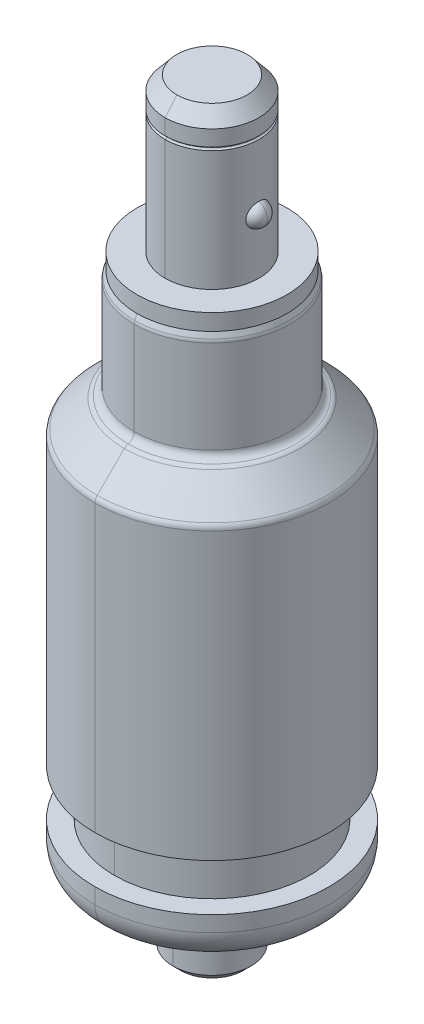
ISO-10303-21;
HEADER;
FILE_DESCRIPTION(('STEP AP214'),'2;1');
FILE_NAME('part.step','',(''),(''),'','','');
FILE_SCHEMA(('AUTOMOTIVE_DESIGN { 1 0 10303 214 1 1 1 1 }'));
ENDSEC;
DATA;
#1=APPLICATION_CONTEXT('core data for automotive mechanical design processes');
#2=APPLICATION_PROTOCOL_DEFINITION('international standard','automotive_design',2000,#1);
#3=PRODUCT_CONTEXT('',#1,'mechanical');
#4=PRODUCT('Part','Part','',(#3));
#5=PRODUCT_RELATED_PRODUCT_CATEGORY('part','',(#4));
#6=PRODUCT_DEFINITION_FORMATION('','',#4);
#7=PRODUCT_DEFINITION_CONTEXT('part definition',#1,'design');
#8=PRODUCT_DEFINITION('design','',#6,#7);
#9=PRODUCT_DEFINITION_SHAPE('','',#8);
#10=(LENGTH_UNIT() NAMED_UNIT(*) SI_UNIT(.MILLI.,.METRE.));
#11=(NAMED_UNIT(*) PLANE_ANGLE_UNIT() SI_UNIT($,.RADIAN.));
#12=(NAMED_UNIT(*) SI_UNIT($,.STERADIAN.) SOLID_ANGLE_UNIT());
#13=UNCERTAINTY_MEASURE_WITH_UNIT(LENGTH_MEASURE(1.E-05),#10,'distance_accuracy_value','');
#14=(GEOMETRIC_REPRESENTATION_CONTEXT(3) GLOBAL_UNCERTAINTY_ASSIGNED_CONTEXT((#13)) GLOBAL_UNIT_ASSIGNED_CONTEXT((#10,
#11,#12)) REPRESENTATION_CONTEXT('',''));
#15=CARTESIAN_POINT('',(0.,0.,0.));
#16=DIRECTION('',(0.,0.,1.));
#17=DIRECTION('',(1.,0.,0.));
#18=AXIS2_PLACEMENT_3D('',#15,#16,#17);
#19=CARTESIAN_POINT('',(0.,-44.3,0.));
#20=DIRECTION('',(0.,1.,0.));
#21=DIRECTION('',(0.,0.,-1.));
#22=AXIS2_PLACEMENT_3D('',#19,#20,#21);
#23=CYLINDRICAL_SURFACE('',#22,5.25);
#24=CARTESIAN_POINT('',(0.,-41.8,0.));
#25=DIRECTION('',(0.,1.,0.));
#26=DIRECTION('',(-1.,0.,0.));
#27=AXIS2_PLACEMENT_3D('',#24,#25,#26);
#28=CIRCLE('',#27,5.25);
#29=CARTESIAN_POINT('',(0.,-41.8,5.25));
#30=VERTEX_POINT('',#29);
#31=CARTESIAN_POINT('',(0.,-41.8,-5.25));
#32=VERTEX_POINT('',#31);
#33=EDGE_CURVE('E884',#30,#32,#28,.F.);
#34=ORIENTED_EDGE('',*,*,#33,.F.);
#35=DIRECTION('',(0.,1.,0.));
#36=VECTOR('',#35,1.);
#37=CARTESIAN_POINT('',(0.,-44.3,5.25));
#38=LINE('',#37,#36);
#39=CARTESIAN_POINT('',(0.,-44.3,5.25));
#40=VERTEX_POINT('',#39);
#41=EDGE_CURVE('E710',#40,#30,#38,.T.);
#42=ORIENTED_EDGE('',*,*,#41,.F.);
#43=CARTESIAN_POINT('',(0.,-44.3,0.));
#44=DIRECTION('',(0.,1.,0.));
#45=DIRECTION('',(0.,0.,-1.));
#46=AXIS2_PLACEMENT_3D('',#43,#44,#45);
#47=CIRCLE('',#46,5.25);
#48=CARTESIAN_POINT('',(0.,-44.3,-5.25));
#49=VERTEX_POINT('',#48);
#50=EDGE_CURVE('E715',#49,#40,#47,.T.);
#51=ORIENTED_EDGE('',*,*,#50,.F.);
#52=DIRECTION('',(0.,1.,0.));
#53=VECTOR('',#52,1.);
#54=CARTESIAN_POINT('',(0.,-44.3,-5.25));
#55=LINE('',#54,#53);
#56=EDGE_CURVE('E713',#49,#32,#55,.T.);
#57=ORIENTED_EDGE('',*,*,#56,.T.);
#58=EDGE_LOOP('',(#34,#42,#51,#57));
#59=FACE_BOUND('',#58,.T.);
#60=ADVANCED_FACE('F16',(#59),#23,.F.);
#61=CARTESIAN_POINT('',(0.,-44.3,0.));
#62=DIRECTION('',(0.,1.,0.));
#63=DIRECTION('',(0.,0.,-1.));
#64=AXIS2_PLACEMENT_3D('',#61,#62,#63);
#65=CYLINDRICAL_SURFACE('',#64,5.25);
#66=CARTESIAN_POINT('',(0.,-41.8,0.));
#67=DIRECTION('',(0.,1.,0.));
#68=DIRECTION('',(-1.,0.,0.));
#69=AXIS2_PLACEMENT_3D('',#66,#67,#68);
#70=CIRCLE('',#69,5.25);
#71=EDGE_CURVE('E34',#32,#30,#70,.F.);
#72=ORIENTED_EDGE('',*,*,#71,.F.);
#73=ORIENTED_EDGE('',*,*,#56,.F.);
#74=CARTESIAN_POINT('',(0.,-44.3,0.));
#75=DIRECTION('',(0.,1.,0.));
#76=DIRECTION('',(0.,0.,-1.));
#77=AXIS2_PLACEMENT_3D('',#74,#75,#76);
#78=CIRCLE('',#77,5.25);
#79=EDGE_CURVE('E714',#40,#49,#78,.T.);
#80=ORIENTED_EDGE('',*,*,#79,.F.);
#81=ORIENTED_EDGE('',*,*,#41,.T.);
#82=EDGE_LOOP('',(#72,#73,#80,#81));
#83=FACE_BOUND('',#82,.T.);
#84=ADVANCED_FACE('F654',(#83),#65,.F.);
#85=CARTESIAN_POINT('',(0.,-10.7,0.));
#86=DIRECTION('',(0.,-1.,0.));
#87=DIRECTION('',(0.,0.,1.));
#88=AXIS2_PLACEMENT_3D('',#85,#86,#87);
#89=CONICAL_SURFACE('',#88,4.75,0.395447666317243);
#90=DIRECTION('',(0.,-0.92282420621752,-0.385221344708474));
#91=VECTOR('',#90,1.);
#92=CARTESIAN_POINT('',(0.,-10.7,-4.75));
#93=LINE('',#92,#91);
#94=CARTESIAN_POINT('',(0.,-10.8466429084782,-4.81121423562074));
#95=VERTEX_POINT('',#94);
#96=CARTESIAN_POINT('',(0.,-11.1705186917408,-4.94641210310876));
#97=VERTEX_POINT('',#96);
#98=EDGE_CURVE('E676',#95,#97,#93,.T.);
#99=ORIENTED_EDGE('',*,*,#98,.F.);
#100=CARTESIAN_POINT('',(0.,-10.8466429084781,0.));
#101=DIRECTION('',(0.,-1.,0.));
#102=DIRECTION('',(0.,0.,-1.));
#103=AXIS2_PLACEMENT_3D('',#100,#101,#102);
#104=CIRCLE('',#103,4.81121423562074);
#105=CARTESIAN_POINT('',(0.,-10.8466429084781,4.81121423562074));
#106=VERTEX_POINT('',#105);
#107=EDGE_CURVE('E355',#95,#106,#104,.T.);
#108=ORIENTED_EDGE('',*,*,#107,.T.);
#109=DIRECTION('',(0.,-0.92282420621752,0.385221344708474));
#110=VECTOR('',#109,1.);
#111=CARTESIAN_POINT('',(0.,-10.7,4.75));
#112=LINE('',#111,#110);
#113=CARTESIAN_POINT('',(0.,-11.1705186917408,4.94641210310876));
#114=VERTEX_POINT('',#113);
#115=EDGE_CURVE('E671',#106,#114,#112,.T.);
#116=ORIENTED_EDGE('',*,*,#115,.T.);
#117=CARTESIAN_POINT('',(0.,-11.1705186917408,0.));
#118=DIRECTION('',(0.,1.,0.));
#119=DIRECTION('',(0.,0.,-1.));
#120=AXIS2_PLACEMENT_3D('',#117,#118,#119);
#121=CIRCLE('',#120,4.94641210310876);
#122=EDGE_CURVE('E728',#114,#97,#121,.T.);
#123=ORIENTED_EDGE('',*,*,#122,.T.);
#124=EDGE_LOOP('',(#99,#108,#116,#123));
#125=FACE_BOUND('',#124,.T.);
#126=ADVANCED_FACE('F648',(#125),#89,.T.);
#127=CARTESIAN_POINT('',(0.,-10.7,0.));
#128=DIRECTION('',(0.,-1.,0.));
#129=DIRECTION('',(0.,0.,1.));
#130=AXIS2_PLACEMENT_3D('',#127,#128,#129);
#131=CONICAL_SURFACE('',#130,4.75,0.395447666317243);
#132=ORIENTED_EDGE('',*,*,#115,.F.);
#133=CARTESIAN_POINT('',(0.,-10.8466429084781,0.));
#134=DIRECTION('',(0.,-1.,0.));
#135=DIRECTION('',(0.,0.,-1.));
#136=AXIS2_PLACEMENT_3D('',#133,#134,#135);
#137=CIRCLE('',#136,4.81121423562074);
#138=EDGE_CURVE('E819',#106,#95,#137,.T.);
#139=ORIENTED_EDGE('',*,*,#138,.T.);
#140=ORIENTED_EDGE('',*,*,#98,.T.);
#141=CARTESIAN_POINT('',(0.,-11.1705186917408,0.));
#142=DIRECTION('',(0.,1.,0.));
#143=DIRECTION('',(0.,0.,-1.));
#144=AXIS2_PLACEMENT_3D('',#141,#142,#143);
#145=CIRCLE('',#144,4.94641210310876);
#146=EDGE_CURVE('E674',#97,#114,#145,.T.);
#147=ORIENTED_EDGE('',*,*,#146,.T.);
#148=EDGE_LOOP('',(#132,#139,#140,#147));
#149=FACE_BOUND('',#148,.T.);
#150=ADVANCED_FACE('F653',(#149),#131,.T.);
#151=CARTESIAN_POINT('',(0.,-20.0171067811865,0.));
#152=DIRECTION('',(0.,1.,0.));
#153=DIRECTION('',(0.,0.,-1.));
#154=AXIS2_PLACEMENT_3D('',#151,#152,#153);
#155=TOROIDAL_SURFACE('',#154,7.,0.5);
#156=CARTESIAN_POINT('',(0.,-20.0171067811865,7.));
#157=DIRECTION('',(-1.,0.,0.));
#158=DIRECTION('',(0.,0.,-1.));
#159=AXIS2_PLACEMENT_3D('',#156,#157,#158);
#160=CIRCLE('',#159,0.5);
#161=CARTESIAN_POINT('',(0.,-20.0171067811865,7.5));
#162=VERTEX_POINT('',#161);
#163=CARTESIAN_POINT('',(0.,-19.6635533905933,7.35355339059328));
#164=VERTEX_POINT('',#163);
#165=EDGE_CURVE('E772',#162,#164,#160,.T.);
#166=ORIENTED_EDGE('',*,*,#165,.F.);
#167=CARTESIAN_POINT('',(0.,-20.0171067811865,0.));
#168=DIRECTION('',(0.,-1.,0.));
#169=DIRECTION('',(0.,0.,-1.));
#170=AXIS2_PLACEMENT_3D('',#167,#168,#169);
#171=CIRCLE('',#170,7.5);
#172=CARTESIAN_POINT('',(0.,-20.0171067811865,-7.5));
#173=VERTEX_POINT('',#172);
#174=EDGE_CURVE('E729',#173,#162,#171,.T.);
#175=ORIENTED_EDGE('',*,*,#174,.F.);
#176=CARTESIAN_POINT('',(0.,-20.0171067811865,-7.));
#177=DIRECTION('',(1.,0.,0.));
#178=DIRECTION('',(0.,0.,1.));
#179=AXIS2_PLACEMENT_3D('',#176,#177,#178);
#180=CIRCLE('',#179,0.5);
#181=CARTESIAN_POINT('',(0.,-19.6635533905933,-7.35355339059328));
#182=VERTEX_POINT('',#181);
#183=EDGE_CURVE('E757',#173,#182,#180,.T.);
#184=ORIENTED_EDGE('',*,*,#183,.T.);
#185=CARTESIAN_POINT('',(0.,-19.6635533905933,0.));
#186=DIRECTION('',(0.,1.,0.));
#187=DIRECTION('',(0.,0.,-1.));
#188=AXIS2_PLACEMENT_3D('',#185,#186,#187);
#189=CIRCLE('',#188,7.35355339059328);
#190=EDGE_CURVE('E751',#164,#182,#189,.T.);
#191=ORIENTED_EDGE('',*,*,#190,.F.);
#192=EDGE_LOOP('',(#166,#175,#184,#191));
#193=FACE_BOUND('',#192,.T.);
#194=ADVANCED_FACE('F665',(#193),#155,.T.);
#195=CARTESIAN_POINT('',(0.,-18.2864746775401,0.));
#196=DIRECTION('',(0.,-1.,0.));
#197=DIRECTION('',(0.,0.,1.));
#198=AXIS2_PLACEMENT_3D('',#195,#196,#197);
#199=TOROIDAL_SURFACE('',#198,5.26936789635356,0.5);
#200=CARTESIAN_POINT('',(0.,-18.2864746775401,-5.26936789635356));
#201=DIRECTION('',(-1.,0.,0.));
#202=DIRECTION('',(0.,0.,-1.));
#203=AXIS2_PLACEMENT_3D('',#200,#201,#202);
#204=CIRCLE('',#203,0.5);
#205=CARTESIAN_POINT('',(0.,-17.79823733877,-5.37718394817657));
#206=VERTEX_POINT('',#205);
#207=CARTESIAN_POINT('',(0.,-17.9329212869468,-5.62292128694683));
#208=VERTEX_POINT('',#207);
#209=EDGE_CURVE('E756',#206,#208,#204,.T.);
#210=ORIENTED_EDGE('',*,*,#209,.F.);
#211=CARTESIAN_POINT('',(0.,-17.79823733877,0.));
#212=DIRECTION('',(0.,1.,0.));
#213=DIRECTION('',(0.,0.,-1.));
#214=AXIS2_PLACEMENT_3D('',#211,#212,#213);
#215=CIRCLE('',#214,5.3771839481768);
#216=CARTESIAN_POINT('',(0.,-17.79823733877,5.37718394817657));
#217=VERTEX_POINT('',#216);
#218=EDGE_CURVE('E723',#217,#206,#215,.T.);
#219=ORIENTED_EDGE('',*,*,#218,.F.);
#220=CARTESIAN_POINT('',(0.,-18.2864746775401,5.26936789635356));
#221=DIRECTION('',(1.,0.,0.));
#222=DIRECTION('',(0.,0.,1.));
#223=AXIS2_PLACEMENT_3D('',#220,#221,#222);
#224=CIRCLE('',#223,0.5);
#225=CARTESIAN_POINT('',(0.,-17.9329212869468,5.62292128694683));
#226=VERTEX_POINT('',#225);
#227=EDGE_CURVE('E825',#217,#226,#224,.T.);
#228=ORIENTED_EDGE('',*,*,#227,.T.);
#229=CARTESIAN_POINT('',(0.,-17.9329212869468,0.));
#230=DIRECTION('',(0.,-1.,0.));
#231=DIRECTION('',(0.,0.,-1.));
#232=AXIS2_PLACEMENT_3D('',#229,#230,#231);
#233=CIRCLE('',#232,5.62292128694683);
#234=EDGE_CURVE('E748',#208,#226,#233,.T.);
#235=ORIENTED_EDGE('',*,*,#234,.F.);
#236=EDGE_LOOP('',(#210,#219,#228,#235));
#237=FACE_BOUND('',#236,.T.);
#238=ADVANCED_FACE('F1096',(#237),#199,.T.);
#239=CARTESIAN_POINT('',(0.,-17.81,0.));
#240=DIRECTION('',(0.,-1.,0.));
#241=DIRECTION('',(0.,0.,1.));
#242=AXIS2_PLACEMENT_3D('',#239,#240,#241);
#243=CONICAL_SURFACE('',#242,5.5,0.785398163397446);
#244=DIRECTION('',(0.,-0.707106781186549,-0.707106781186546));
#245=VECTOR('',#244,1.);
#246=CARTESIAN_POINT('',(0.,-17.81,-5.5));
#247=LINE('',#246,#245);
#248=EDGE_CURVE('E688',#208,#182,#247,.T.);
#249=ORIENTED_EDGE('',*,*,#248,.F.);
#250=ORIENTED_EDGE('',*,*,#234,.T.);
#251=DIRECTION('',(0.,-0.707106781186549,0.707106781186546));
#252=VECTOR('',#251,1.);
#253=CARTESIAN_POINT('',(0.,-17.81,5.5));
#254=LINE('',#253,#252);
#255=EDGE_CURVE('E678',#226,#164,#254,.T.);
#256=ORIENTED_EDGE('',*,*,#255,.T.);
#257=ORIENTED_EDGE('',*,*,#190,.T.);
#258=EDGE_LOOP('',(#249,#250,#256,#257));
#259=FACE_BOUND('',#258,.T.);
#260=ADVANCED_FACE('F1079',(#259),#243,.T.);
#261=CARTESIAN_POINT('',(0.,-11.363129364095,0.));
#262=DIRECTION('',(0.,1.,0.));
#263=DIRECTION('',(0.,0.,-1.));
#264=AXIS2_PLACEMENT_3D('',#261,#262,#263);
#265=TOROIDAL_SURFACE('',#264,4.485,0.5);
#266=CARTESIAN_POINT('',(0.,-11.363129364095,4.485));
#267=DIRECTION('',(-1.,0.,0.));
#268=DIRECTION('',(0.,0.,-1.));
#269=AXIS2_PLACEMENT_3D('',#266,#267,#268);
#270=CIRCLE('',#269,0.5);
#271=CARTESIAN_POINT('',(0.,-11.363129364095,4.985));
#272=VERTEX_POINT('',#271);
#273=EDGE_CURVE('E758',#272,#114,#270,.T.);
#274=ORIENTED_EDGE('',*,*,#273,.F.);
#275=CARTESIAN_POINT('',(0.,-11.363129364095,0.));
#276=DIRECTION('',(0.,1.,0.));
#277=DIRECTION('',(0.,0.,-1.));
#278=AXIS2_PLACEMENT_3D('',#275,#276,#277);
#279=CIRCLE('',#278,4.985);
#280=CARTESIAN_POINT('',(0.,-11.363129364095,-4.985));
#281=VERTEX_POINT('',#280);
#282=EDGE_CURVE('E725',#272,#281,#279,.T.);
#283=ORIENTED_EDGE('',*,*,#282,.T.);
#284=CARTESIAN_POINT('',(0.,-11.363129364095,-4.485));
#285=DIRECTION('',(1.,0.,0.));
#286=DIRECTION('',(0.,0.,1.));
#287=AXIS2_PLACEMENT_3D('',#284,#285,#286);
#288=CIRCLE('',#287,0.5);
#289=EDGE_CURVE('E762',#281,#97,#288,.T.);
#290=ORIENTED_EDGE('',*,*,#289,.T.);
#291=ORIENTED_EDGE('',*,*,#122,.F.);
#292=EDGE_LOOP('',(#274,#283,#290,#291));
#293=FACE_BOUND('',#292,.T.);
#294=ADVANCED_FACE('F1076',(#293),#265,.T.);
#295=CARTESIAN_POINT('',(0.,-44.3,0.));
#296=DIRECTION('',(0.,1.,0.));
#297=DIRECTION('',(0.,0.,-1.));
#298=AXIS2_PLACEMENT_3D('',#295,#296,#297);
#299=CYLINDRICAL_SURFACE('',#298,4.985);
#300=DIRECTION('',(0.,1.,0.));
#301=VECTOR('',#300,1.);
#302=CARTESIAN_POINT('',(0.,-44.3,4.985));
#303=LINE('',#302,#301);
#304=CARTESIAN_POINT('',(0.,-17.31,4.985));
#305=VERTEX_POINT('',#304);
#306=EDGE_CURVE('E816',#305,#272,#303,.T.);
#307=ORIENTED_EDGE('',*,*,#306,.F.);
#308=CARTESIAN_POINT('',(0.,-17.31,0.));
#309=DIRECTION('',(0.,1.,0.));
#310=DIRECTION('',(0.,0.,-1.));
#311=AXIS2_PLACEMENT_3D('',#308,#309,#310);
#312=CIRCLE('',#311,4.985);
#313=CARTESIAN_POINT('',(0.,-17.31,-4.985));
#314=VERTEX_POINT('',#313);
#315=EDGE_CURVE('E724',#305,#314,#312,.T.);
#316=ORIENTED_EDGE('',*,*,#315,.T.);
#317=DIRECTION('',(0.,1.,0.));
#318=VECTOR('',#317,1.);
#319=CARTESIAN_POINT('',(0.,-44.3,-4.985));
#320=LINE('',#319,#318);
#321=EDGE_CURVE('E802',#314,#281,#320,.T.);
#322=ORIENTED_EDGE('',*,*,#321,.T.);
#323=ORIENTED_EDGE('',*,*,#282,.F.);
#324=EDGE_LOOP('',(#307,#316,#322,#323));
#325=FACE_BOUND('',#324,.T.);
#326=ADVANCED_FACE('F1074',(#325),#299,.T.);
#327=CARTESIAN_POINT('',(0.,-17.31,0.));
#328=DIRECTION('',(0.,1.,0.));
#329=DIRECTION('',(0.,0.,-1.));
#330=AXIS2_PLACEMENT_3D('',#327,#328,#329);
#331=TOROIDAL_SURFACE('',#330,5.485,0.5);
#332=CARTESIAN_POINT('',(0.,-17.31,5.485));
#333=DIRECTION('',(-1.,0.,0.));
#334=DIRECTION('',(0.,0.,-1.));
#335=AXIS2_PLACEMENT_3D('',#332,#333,#334);
#336=CIRCLE('',#335,0.5);
#337=EDGE_CURVE('E719',#305,#217,#336,.T.);
#338=ORIENTED_EDGE('',*,*,#337,.F.);
#339=CARTESIAN_POINT('',(0.,-17.31,0.));
#340=DIRECTION('',(0.,1.,0.));
#341=DIRECTION('',(0.,0.,-1.));
#342=AXIS2_PLACEMENT_3D('',#339,#340,#341);
#343=CIRCLE('',#342,4.985);
#344=EDGE_CURVE('E778',#314,#305,#343,.T.);
#345=ORIENTED_EDGE('',*,*,#344,.F.);
#346=CARTESIAN_POINT('',(0.,-17.31,-5.485));
#347=DIRECTION('',(1.,0.,0.));
#348=DIRECTION('',(0.,0.,1.));
#349=AXIS2_PLACEMENT_3D('',#346,#347,#348);
#350=CIRCLE('',#349,0.5);
#351=EDGE_CURVE('E735',#314,#206,#350,.T.);
#352=ORIENTED_EDGE('',*,*,#351,.T.);
#353=CARTESIAN_POINT('',(0.,-17.79823733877,0.));
#354=DIRECTION('',(0.,1.,0.));
#355=DIRECTION('',(0.,0.,-1.));
#356=AXIS2_PLACEMENT_3D('',#353,#354,#355);
#357=CIRCLE('',#356,5.3771839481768);
#358=EDGE_CURVE('E752',#206,#217,#357,.T.);
#359=ORIENTED_EDGE('',*,*,#358,.T.);
#360=EDGE_LOOP('',(#338,#345,#352,#359));
#361=FACE_BOUND('',#360,.T.);
#362=ADVANCED_FACE('F1053',(#361),#331,.F.);
#363=CARTESIAN_POINT('',(0.,-44.3,0.));
#364=DIRECTION('',(0.,1.,0.));
#365=DIRECTION('',(0.,0.,-1.));
#366=AXIS2_PLACEMENT_3D('',#363,#364,#365);
#367=CYLINDRICAL_SURFACE('',#366,7.5);
#368=DIRECTION('',(0.,1.,0.));
#369=VECTOR('',#368,1.);
#370=CARTESIAN_POINT('',(0.,-44.3,7.5));
#371=LINE('',#370,#369);
#372=CARTESIAN_POINT('',(0.,-38.3,7.5));
#373=VERTEX_POINT('',#372);
#374=EDGE_CURVE('E734',#373,#162,#371,.T.);
#375=ORIENTED_EDGE('',*,*,#374,.F.);
#376=CARTESIAN_POINT('',(0.,-38.3,0.));
#377=DIRECTION('',(0.,1.,0.));
#378=DIRECTION('',(0.,0.,-1.));
#379=AXIS2_PLACEMENT_3D('',#376,#377,#378);
#380=CIRCLE('',#379,7.5);
#381=CARTESIAN_POINT('',(0.,-38.3,-7.5));
#382=VERTEX_POINT('',#381);
#383=EDGE_CURVE('E702',#373,#382,#380,.T.);
#384=ORIENTED_EDGE('',*,*,#383,.T.);
#385=DIRECTION('',(0.,1.,0.));
#386=VECTOR('',#385,1.);
#387=CARTESIAN_POINT('',(0.,-44.3,-7.5));
#388=LINE('',#387,#386);
#389=EDGE_CURVE('E747',#382,#173,#388,.T.);
#390=ORIENTED_EDGE('',*,*,#389,.T.);
#391=ORIENTED_EDGE('',*,*,#174,.T.);
#392=EDGE_LOOP('',(#375,#384,#390,#391));
#393=FACE_BOUND('',#392,.T.);
#394=ADVANCED_FACE('F1049',(#393),#367,.T.);
#395=CARTESIAN_POINT('',(-7.5,-38.3,0.));
#396=DIRECTION('',(0.,-1.,0.));
#397=DIRECTION('',(-1.,0.,0.));
#398=AXIS2_PLACEMENT_3D('',#395,#396,#397);
#399=PLANE('',#398);
#400=CARTESIAN_POINT('',(0.,-38.3,0.));
#401=DIRECTION('',(0.,1.,0.));
#402=DIRECTION('',(0.,0.,-1.));
#403=AXIS2_PLACEMENT_3D('',#400,#401,#402);
#404=CIRCLE('',#403,6.25);
#405=CARTESIAN_POINT('',(0.,-38.3,-6.25));
#406=VERTEX_POINT('',#405);
#407=CARTESIAN_POINT('',(0.,-38.3,6.25));
#408=VERTEX_POINT('',#407);
#409=EDGE_CURVE('E709',#406,#408,#404,.T.);
#410=ORIENTED_EDGE('',*,*,#409,.T.);
#411=CARTESIAN_POINT('',(0.,-38.3,0.));
#412=DIRECTION('',(0.,1.,0.));
#413=DIRECTION('',(0.,0.,-1.));
#414=AXIS2_PLACEMENT_3D('',#411,#412,#413);
#415=CIRCLE('',#414,6.25);
#416=EDGE_CURVE('E699',#408,#406,#415,.T.);
#417=ORIENTED_EDGE('',*,*,#416,.T.);
#418=EDGE_LOOP('',(#410,#417));
#419=FACE_BOUND('',#418,.T.);
#420=CARTESIAN_POINT('',(0.,-38.3,0.));
#421=DIRECTION('',(0.,1.,0.));
#422=DIRECTION('',(0.,0.,-1.));
#423=AXIS2_PLACEMENT_3D('',#420,#421,#422);
#424=CIRCLE('',#423,7.5);
#425=EDGE_CURVE('E730',#382,#373,#424,.T.);
#426=ORIENTED_EDGE('',*,*,#425,.F.);
#427=ORIENTED_EDGE('',*,*,#383,.F.);
#428=EDGE_LOOP('',(#426,#427));
#429=FACE_BOUND('',#428,.T.);
#430=ADVANCED_FACE('F1052',(#419,#429),#399,.T.);
#431=CARTESIAN_POINT('',(0.,-44.3,0.));
#432=DIRECTION('',(0.,1.,0.));
#433=DIRECTION('',(0.,0.,-1.));
#434=AXIS2_PLACEMENT_3D('',#431,#432,#433);
#435=CYLINDRICAL_SURFACE('',#434,6.25);
#436=DIRECTION('',(0.,1.,0.));
#437=VECTOR('',#436,1.);
#438=CARTESIAN_POINT('',(0.,-44.3,6.25));
#439=LINE('',#438,#437);
#440=CARTESIAN_POINT('',(0.,-41.3,6.25));
#441=VERTEX_POINT('',#440);
#442=EDGE_CURVE('E746',#441,#408,#439,.T.);
#443=ORIENTED_EDGE('',*,*,#442,.F.);
#444=CARTESIAN_POINT('',(0.,-41.3,0.));
#445=DIRECTION('',(0.,1.,0.));
#446=DIRECTION('',(0.,0.,-1.));
#447=AXIS2_PLACEMENT_3D('',#444,#445,#446);
#448=CIRCLE('',#447,6.25);
#449=CARTESIAN_POINT('',(0.,-41.3,-6.25));
#450=VERTEX_POINT('',#449);
#451=EDGE_CURVE('E703',#441,#450,#448,.T.);
#452=ORIENTED_EDGE('',*,*,#451,.T.);
#453=DIRECTION('',(0.,1.,0.));
#454=VECTOR('',#453,1.);
#455=CARTESIAN_POINT('',(0.,-44.3,-6.25));
#456=LINE('',#455,#454);
#457=EDGE_CURVE('E704',#450,#406,#456,.T.);
#458=ORIENTED_EDGE('',*,*,#457,.T.);
#459=ORIENTED_EDGE('',*,*,#416,.F.);
#460=EDGE_LOOP('',(#443,#452,#458,#459));
#461=FACE_BOUND('',#460,.T.);
#462=ADVANCED_FACE('F1036',(#461),#435,.T.);
#463=CARTESIAN_POINT('',(-6.25,-41.3,0.));
#464=DIRECTION('',(0.,1.,0.));
#465=DIRECTION('',(0.,0.,-1.));
#466=AXIS2_PLACEMENT_3D('',#463,#464,#465);
#467=PLANE('',#466);
#468=CARTESIAN_POINT('',(0.,-41.3,0.));
#469=DIRECTION('',(0.,1.,0.));
#470=DIRECTION('',(0.,0.,-1.));
#471=AXIS2_PLACEMENT_3D('',#468,#469,#470);
#472=CIRCLE('',#471,6.25);
#473=EDGE_CURVE('E742',#450,#441,#472,.T.);
#474=ORIENTED_EDGE('',*,*,#473,.F.);
#475=ORIENTED_EDGE('',*,*,#451,.F.);
#476=EDGE_LOOP('',(#474,#475));
#477=FACE_BOUND('',#476,.T.);
#478=CARTESIAN_POINT('',(0.,-41.3,0.));
#479=DIRECTION('',(0.,1.,0.));
#480=DIRECTION('',(0.,0.,-1.));
#481=AXIS2_PLACEMENT_3D('',#478,#479,#480);
#482=CIRCLE('',#481,7.5);
#483=CARTESIAN_POINT('',(0.,-41.3,-7.5));
#484=VERTEX_POINT('',#483);
#485=CARTESIAN_POINT('',(0.,-41.3,7.5));
#486=VERTEX_POINT('',#485);
#487=EDGE_CURVE('E736',#484,#486,#482,.T.);
#488=ORIENTED_EDGE('',*,*,#487,.T.);
#489=CARTESIAN_POINT('',(0.,-41.3,0.));
#490=DIRECTION('',(0.,1.,0.));
#491=DIRECTION('',(0.,0.,-1.));
#492=AXIS2_PLACEMENT_3D('',#489,#490,#491);
#493=CIRCLE('',#492,7.5);
#494=EDGE_CURVE('E806',#486,#484,#493,.T.);
#495=ORIENTED_EDGE('',*,*,#494,.T.);
#496=EDGE_LOOP('',(#488,#495));
#497=FACE_BOUND('',#496,.T.);
#498=ADVANCED_FACE('F1044',(#477,#497),#467,.T.);
#499=CARTESIAN_POINT('',(0.,-44.3,0.));
#500=DIRECTION('',(0.,1.,0.));
#501=DIRECTION('',(0.,0.,-1.));
#502=AXIS2_PLACEMENT_3D('',#499,#500,#501);
#503=CYLINDRICAL_SURFACE('',#502,7.5);
#504=DIRECTION('',(0.,1.,0.));
#505=VECTOR('',#504,1.);
#506=CARTESIAN_POINT('',(0.,-44.3,7.5));
#507=LINE('',#506,#505);
#508=CARTESIAN_POINT('',(0.,-42.3000724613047,7.5));
#509=VERTEX_POINT('',#508);
#510=EDGE_CURVE('E741',#509,#486,#507,.T.);
#511=ORIENTED_EDGE('',*,*,#510,.F.);
#512=CARTESIAN_POINT('',(0.,-42.3000724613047,0.));
#513=DIRECTION('',(0.,1.,0.));
#514=DIRECTION('',(0.,0.,-1.));
#515=AXIS2_PLACEMENT_3D('',#512,#513,#514);
#516=CIRCLE('',#515,7.5);
#517=CARTESIAN_POINT('',(0.,-42.3000724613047,-7.5));
#518=VERTEX_POINT('',#517);
#519=EDGE_CURVE('E803',#509,#518,#516,.T.);
#520=ORIENTED_EDGE('',*,*,#519,.T.);
#521=DIRECTION('',(0.,1.,0.));
#522=VECTOR('',#521,1.);
#523=CARTESIAN_POINT('',(0.,-44.3,-7.5));
#524=LINE('',#523,#522);
#525=EDGE_CURVE('E740',#518,#484,#524,.T.);
#526=ORIENTED_EDGE('',*,*,#525,.T.);
#527=ORIENTED_EDGE('',*,*,#494,.F.);
#528=EDGE_LOOP('',(#511,#520,#526,#527));
#529=FACE_BOUND('',#528,.T.);
#530=ADVANCED_FACE('F1047',(#529),#503,.T.);
#531=CARTESIAN_POINT('',(0.,-42.3000724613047,0.));
#532=DIRECTION('',(0.,1.,0.));
#533=DIRECTION('',(0.,0.,-1.));
#534=AXIS2_PLACEMENT_3D('',#531,#532,#533);
#535=TOROIDAL_SURFACE('',#534,5.50007246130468,1.99992753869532);
#536=CARTESIAN_POINT('',(0.,-42.3000724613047,5.50007246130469));
#537=DIRECTION('',(-1.,0.,0.));
#538=DIRECTION('',(0.,0.,-1.));
#539=AXIS2_PLACEMENT_3D('',#536,#537,#538);
#540=CIRCLE('',#539,1.99992753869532);
#541=CARTESIAN_POINT('',(0.,-44.3,5.50007246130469));
#542=VERTEX_POINT('',#541);
#543=EDGE_CURVE('E693',#542,#509,#540,.T.);
#544=ORIENTED_EDGE('',*,*,#543,.F.);
#545=CARTESIAN_POINT('',(0.,-44.3,0.));
#546=DIRECTION('',(0.,1.,0.));
#547=DIRECTION('',(0.,0.,-1.));
#548=AXIS2_PLACEMENT_3D('',#545,#546,#547);
#549=CIRCLE('',#548,5.50007246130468);
#550=CARTESIAN_POINT('',(0.,-44.3,-5.50007246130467));
#551=VERTEX_POINT('',#550);
#552=EDGE_CURVE('E718',#542,#551,#549,.T.);
#553=ORIENTED_EDGE('',*,*,#552,.T.);
#554=CARTESIAN_POINT('',(0.,-42.3000724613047,-5.50007246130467));
#555=DIRECTION('',(1.,0.,0.));
#556=DIRECTION('',(0.,0.,1.));
#557=AXIS2_PLACEMENT_3D('',#554,#555,#556);
#558=CIRCLE('',#557,1.99992753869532);
#559=EDGE_CURVE('E697',#551,#518,#558,.T.);
#560=ORIENTED_EDGE('',*,*,#559,.T.);
#561=ORIENTED_EDGE('',*,*,#519,.F.);
#562=EDGE_LOOP('',(#544,#553,#560,#561));
#563=FACE_BOUND('',#562,.T.);
#564=ADVANCED_FACE('F1061',(#563),#535,.T.);
#565=CARTESIAN_POINT('',(-5.50007246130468,-44.3,0.));
#566=DIRECTION('',(0.,-1.,0.));
#567=DIRECTION('',(-1.,0.,0.));
#568=AXIS2_PLACEMENT_3D('',#565,#566,#567);
#569=PLANE('',#568);
#570=ORIENTED_EDGE('',*,*,#50,.T.);
#571=ORIENTED_EDGE('',*,*,#79,.T.);
#572=EDGE_LOOP('',(#570,#571));
#573=FACE_BOUND('',#572,.T.);
#574=CARTESIAN_POINT('',(0.,-44.3,0.));
#575=DIRECTION('',(0.,1.,0.));
#576=DIRECTION('',(0.,0.,-1.));
#577=AXIS2_PLACEMENT_3D('',#574,#575,#576);
#578=CIRCLE('',#577,5.50007246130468);
#579=EDGE_CURVE('E698',#551,#542,#578,.T.);
#580=ORIENTED_EDGE('',*,*,#579,.F.);
#581=ORIENTED_EDGE('',*,*,#552,.F.);
#582=EDGE_LOOP('',(#580,#581));
#583=FACE_BOUND('',#582,.T.);
#584=ADVANCED_FACE('F1064',(#573,#583),#569,.T.);
#585=CARTESIAN_POINT('',(0.,-42.3000724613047,0.));
#586=DIRECTION('',(0.,1.,0.));
#587=DIRECTION('',(0.,0.,-1.));
#588=AXIS2_PLACEMENT_3D('',#585,#586,#587);
#589=TOROIDAL_SURFACE('',#588,5.50007246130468,1.99992753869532);
#590=ORIENTED_EDGE('',*,*,#579,.T.);
#591=ORIENTED_EDGE('',*,*,#543,.T.);
#592=CARTESIAN_POINT('',(0.,-42.3000724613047,0.));
#593=DIRECTION('',(0.,1.,0.));
#594=DIRECTION('',(0.,0.,-1.));
#595=AXIS2_PLACEMENT_3D('',#592,#593,#594);
#596=CIRCLE('',#595,7.5);
#597=EDGE_CURVE('E708',#518,#509,#596,.T.);
#598=ORIENTED_EDGE('',*,*,#597,.F.);
#599=ORIENTED_EDGE('',*,*,#559,.F.);
#600=EDGE_LOOP('',(#590,#591,#598,#599));
#601=FACE_BOUND('',#600,.T.);
#602=ADVANCED_FACE('F1083',(#601),#589,.T.);
#603=CARTESIAN_POINT('',(0.,-44.3,0.));
#604=DIRECTION('',(0.,1.,0.));
#605=DIRECTION('',(0.,0.,-1.));
#606=AXIS2_PLACEMENT_3D('',#603,#604,#605);
#607=CYLINDRICAL_SURFACE('',#606,7.5);
#608=ORIENTED_EDGE('',*,*,#597,.T.);
#609=ORIENTED_EDGE('',*,*,#510,.T.);
#610=ORIENTED_EDGE('',*,*,#487,.F.);
#611=ORIENTED_EDGE('',*,*,#525,.F.);
#612=EDGE_LOOP('',(#608,#609,#610,#611));
#613=FACE_BOUND('',#612,.T.);
#614=ADVANCED_FACE('F1042',(#613),#607,.T.);
#615=CARTESIAN_POINT('',(0.,-44.3,0.));
#616=DIRECTION('',(0.,1.,0.));
#617=DIRECTION('',(0.,0.,-1.));
#618=AXIS2_PLACEMENT_3D('',#615,#616,#617);
#619=CYLINDRICAL_SURFACE('',#618,6.25);
#620=ORIENTED_EDGE('',*,*,#473,.T.);
#621=ORIENTED_EDGE('',*,*,#442,.T.);
#622=ORIENTED_EDGE('',*,*,#409,.F.);
#623=ORIENTED_EDGE('',*,*,#457,.F.);
#624=EDGE_LOOP('',(#620,#621,#622,#623));
#625=FACE_BOUND('',#624,.T.);
#626=ADVANCED_FACE('F1038',(#625),#619,.T.);
#627=CARTESIAN_POINT('',(0.,-44.3,0.));
#628=DIRECTION('',(0.,1.,0.));
#629=DIRECTION('',(0.,0.,-1.));
#630=AXIS2_PLACEMENT_3D('',#627,#628,#629);
#631=CYLINDRICAL_SURFACE('',#630,7.5);
#632=ORIENTED_EDGE('',*,*,#425,.T.);
#633=ORIENTED_EDGE('',*,*,#374,.T.);
#634=CARTESIAN_POINT('',(0.,-20.0171067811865,0.));
#635=DIRECTION('',(0.,-1.,0.));
#636=DIRECTION('',(0.,0.,-1.));
#637=AXIS2_PLACEMENT_3D('',#634,#635,#636);
#638=CIRCLE('',#637,7.5);
#639=EDGE_CURVE('E785',#162,#173,#638,.T.);
#640=ORIENTED_EDGE('',*,*,#639,.T.);
#641=ORIENTED_EDGE('',*,*,#389,.F.);
#642=EDGE_LOOP('',(#632,#633,#640,#641));
#643=FACE_BOUND('',#642,.T.);
#644=ADVANCED_FACE('F1041',(#643),#631,.T.);
#645=CARTESIAN_POINT('',(0.,-17.31,0.));
#646=DIRECTION('',(0.,1.,0.));
#647=DIRECTION('',(0.,0.,-1.));
#648=AXIS2_PLACEMENT_3D('',#645,#646,#647);
#649=TOROIDAL_SURFACE('',#648,5.485,0.5);
#650=ORIENTED_EDGE('',*,*,#315,.F.);
#651=ORIENTED_EDGE('',*,*,#337,.T.);
#652=ORIENTED_EDGE('',*,*,#218,.T.);
#653=ORIENTED_EDGE('',*,*,#351,.F.);
#654=EDGE_LOOP('',(#650,#651,#652,#653));
#655=FACE_BOUND('',#654,.T.);
#656=ADVANCED_FACE('F1092',(#655),#649,.F.);
#657=CARTESIAN_POINT('',(0.,-44.3,0.));
#658=DIRECTION('',(0.,1.,0.));
#659=DIRECTION('',(0.,0.,-1.));
#660=AXIS2_PLACEMENT_3D('',#657,#658,#659);
#661=CYLINDRICAL_SURFACE('',#660,4.985);
#662=ORIENTED_EDGE('',*,*,#344,.T.);
#663=ORIENTED_EDGE('',*,*,#306,.T.);
#664=CARTESIAN_POINT('',(0.,-11.363129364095,0.));
#665=DIRECTION('',(0.,1.,0.));
#666=DIRECTION('',(0.,0.,-1.));
#667=AXIS2_PLACEMENT_3D('',#664,#665,#666);
#668=CIRCLE('',#667,4.985);
#669=EDGE_CURVE('E673',#281,#272,#668,.T.);
#670=ORIENTED_EDGE('',*,*,#669,.F.);
#671=ORIENTED_EDGE('',*,*,#321,.F.);
#672=EDGE_LOOP('',(#662,#663,#670,#671));
#673=FACE_BOUND('',#672,.T.);
#674=ADVANCED_FACE('F1102',(#673),#661,.T.);
#675=CARTESIAN_POINT('',(0.,-11.363129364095,0.));
#676=DIRECTION('',(0.,1.,0.));
#677=DIRECTION('',(0.,0.,-1.));
#678=AXIS2_PLACEMENT_3D('',#675,#676,#677);
#679=TOROIDAL_SURFACE('',#678,4.485,0.5);
#680=ORIENTED_EDGE('',*,*,#669,.T.);
#681=ORIENTED_EDGE('',*,*,#273,.T.);
#682=ORIENTED_EDGE('',*,*,#146,.F.);
#683=ORIENTED_EDGE('',*,*,#289,.F.);
#684=EDGE_LOOP('',(#680,#681,#682,#683));
#685=FACE_BOUND('',#684,.T.);
#686=ADVANCED_FACE('F18',(#685),#679,.T.);
#687=CARTESIAN_POINT('',(0.,-17.81,0.));
#688=DIRECTION('',(0.,-1.,0.));
#689=DIRECTION('',(0.,0.,1.));
#690=AXIS2_PLACEMENT_3D('',#687,#688,#689);
#691=CONICAL_SURFACE('',#690,5.5,0.785398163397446);
#692=CARTESIAN_POINT('',(0.,-17.9329212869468,0.));
#693=DIRECTION('',(0.,-1.,0.));
#694=DIRECTION('',(0.,0.,-1.));
#695=AXIS2_PLACEMENT_3D('',#692,#693,#694);
#696=CIRCLE('',#695,5.62292128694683);
#697=EDGE_CURVE('E829',#226,#208,#696,.T.);
#698=ORIENTED_EDGE('',*,*,#697,.T.);
#699=ORIENTED_EDGE('',*,*,#248,.T.);
#700=CARTESIAN_POINT('',(0.,-19.6635533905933,0.));
#701=DIRECTION('',(0.,1.,0.));
#702=DIRECTION('',(0.,0.,-1.));
#703=AXIS2_PLACEMENT_3D('',#700,#701,#702);
#704=CIRCLE('',#703,7.35355339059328);
#705=EDGE_CURVE('E768',#182,#164,#704,.T.);
#706=ORIENTED_EDGE('',*,*,#705,.T.);
#707=ORIENTED_EDGE('',*,*,#255,.F.);
#708=EDGE_LOOP('',(#698,#699,#706,#707));
#709=FACE_BOUND('',#708,.T.);
#710=ADVANCED_FACE('F1059',(#709),#691,.T.);
#711=CARTESIAN_POINT('',(0.,-18.2864746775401,0.));
#712=DIRECTION('',(0.,-1.,0.));
#713=DIRECTION('',(0.,0.,1.));
#714=AXIS2_PLACEMENT_3D('',#711,#712,#713);
#715=TOROIDAL_SURFACE('',#714,5.26936789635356,0.5);
#716=ORIENTED_EDGE('',*,*,#358,.F.);
#717=ORIENTED_EDGE('',*,*,#209,.T.);
#718=ORIENTED_EDGE('',*,*,#697,.F.);
#719=ORIENTED_EDGE('',*,*,#227,.F.);
#720=EDGE_LOOP('',(#716,#717,#718,#719));
#721=FACE_BOUND('',#720,.T.);
#722=ADVANCED_FACE('F1055',(#721),#715,.T.);
#723=CARTESIAN_POINT('',(0.,-20.0171067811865,0.));
#724=DIRECTION('',(0.,1.,0.));
#725=DIRECTION('',(0.,0.,-1.));
#726=AXIS2_PLACEMENT_3D('',#723,#724,#725);
#727=TOROIDAL_SURFACE('',#726,7.,0.5);
#728=ORIENTED_EDGE('',*,*,#639,.F.);
#729=ORIENTED_EDGE('',*,*,#165,.T.);
#730=ORIENTED_EDGE('',*,*,#705,.F.);
#731=ORIENTED_EDGE('',*,*,#183,.F.);
#732=EDGE_LOOP('',(#728,#729,#730,#731));
#733=FACE_BOUND('',#732,.T.);
#734=ADVANCED_FACE('F1058',(#733),#727,.T.);
#735=CARTESIAN_POINT('',(0.,0.,0.));
#736=DIRECTION('',(0.,1.,0.));
#737=DIRECTION('',(-1.,0.,0.));
#738=AXIS2_PLACEMENT_3D('',#735,#736,#737);
#739=CYLINDRICAL_SURFACE('',#738,4.81121423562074);
#740=ORIENTED_EDGE('',*,*,#107,.F.);
#741=ORIENTED_EDGE('',*,*,#138,.F.);
#742=EDGE_LOOP('',(#740,#741));
#743=FACE_BOUND('',#742,.T.);
#744=CARTESIAN_POINT('',(0.,-9.8,0.));
#745=DIRECTION('',(0.,1.,0.));
#746=DIRECTION('',(-1.,0.,0.));
#747=AXIS2_PLACEMENT_3D('',#744,#745,#746);
#748=CIRCLE('',#747,4.81121423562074);
#749=CARTESIAN_POINT('',(-4.81121423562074,-9.8,0.));
#750=VERTEX_POINT('',#749);
#751=EDGE_CURVE('E347',#750,#750,#748,.T.);
#752=ORIENTED_EDGE('',*,*,#751,.F.);
#753=EDGE_LOOP('',(#752));
#754=FACE_BOUND('',#753,.T.);
#755=ADVANCED_FACE('F1087',(#743,#754),#739,.T.);
#756=CARTESIAN_POINT('',(-3.05,-9.8,0.));
#757=DIRECTION('',(0.,1.,0.));
#758=DIRECTION('',(0.,0.,-1.));
#759=AXIS2_PLACEMENT_3D('',#756,#757,#758);
#760=PLANE('',#759);
#761=CARTESIAN_POINT('',(0.,-9.8,0.));
#762=DIRECTION('',(0.,1.,0.));
#763=DIRECTION('',(0.,0.,1.));
#764=AXIS2_PLACEMENT_3D('',#761,#762,#763);
#765=CIRCLE('',#764,3.);
#766=CARTESIAN_POINT('',(0.,-9.8,3.));
#767=VERTEX_POINT('',#766);
#768=CARTESIAN_POINT('',(0.,-9.8,-3.));
#769=VERTEX_POINT('',#768);
#770=EDGE_CURVE('E26',#767,#769,#765,.T.);
#771=ORIENTED_EDGE('',*,*,#770,.F.);
#772=CARTESIAN_POINT('',(0.,-9.8,0.));
#773=DIRECTION('',(0.,1.,0.));
#774=DIRECTION('',(0.,0.,1.));
#775=AXIS2_PLACEMENT_3D('',#772,#773,#774);
#776=CIRCLE('',#775,3.);
#777=EDGE_CURVE('E846',#769,#767,#776,.T.);
#778=ORIENTED_EDGE('',*,*,#777,.F.);
#779=EDGE_LOOP('',(#771,#778));
#780=FACE_BOUND('',#779,.T.);
#781=ORIENTED_EDGE('',*,*,#751,.T.);
#782=EDGE_LOOP('',(#781));
#783=FACE_BOUND('',#782,.T.);
#784=ADVANCED_FACE('F449',(#780,#783),#760,.T.);
#785=CARTESIAN_POINT('',(2.25,0.,0.));
#786=DIRECTION('',(0.,-1.,0.));
#787=DIRECTION('',(-1.,0.,0.));
#788=AXIS2_PLACEMENT_3D('',#785,#786,#787);
#789=PLANE('',#788);
#790=CARTESIAN_POINT('',(0.,0.,0.));
#791=DIRECTION('',(0.,1.,0.));
#792=DIRECTION('',(0.,0.,-1.));
#793=AXIS2_PLACEMENT_3D('',#790,#791,#792);
#794=CIRCLE('',#793,2.25);
#795=CARTESIAN_POINT('',(0.,0.,2.25));
#796=VERTEX_POINT('',#795);
#797=CARTESIAN_POINT('',(0.,0.,-2.25));
#798=VERTEX_POINT('',#797);
#799=EDGE_CURVE('E506',#796,#798,#794,.T.);
#800=ORIENTED_EDGE('',*,*,#799,.T.);
#801=CARTESIAN_POINT('',(0.,0.,0.));
#802=DIRECTION('',(0.,1.,0.));
#803=DIRECTION('',(0.,0.,-1.));
#804=AXIS2_PLACEMENT_3D('',#801,#802,#803);
#805=CIRCLE('',#804,2.25);
#806=EDGE_CURVE('E920',#798,#796,#805,.T.);
#807=ORIENTED_EDGE('',*,*,#806,.T.);
#808=EDGE_LOOP('',(#800,#807));
#809=FACE_BOUND('',#808,.T.);
#810=ADVANCED_FACE('F445',(#809),#789,.F.);
#811=CARTESIAN_POINT('',(0.,-0.891385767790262,0.));
#812=DIRECTION('',(0.,-1.,0.));
#813=DIRECTION('',(0.,0.,1.));
#814=AXIS2_PLACEMENT_3D('',#811,#812,#813);
#815=CONICAL_SURFACE('',#814,3.,0.699472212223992);
#816=DIRECTION('',(0.,-0.765182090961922,-0.643813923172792));
#817=VECTOR('',#816,1.);
#818=CARTESIAN_POINT('',(0.,-0.891385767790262,-3.));
#819=LINE('',#818,#817);
#820=CARTESIAN_POINT('',(0.,-0.891385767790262,-3.));
#821=VERTEX_POINT('',#820);
#822=EDGE_CURVE('E878',#798,#821,#819,.T.);
#823=ORIENTED_EDGE('',*,*,#822,.F.);
#824=ORIENTED_EDGE('',*,*,#799,.F.);
#825=DIRECTION('',(0.,-0.765182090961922,0.643813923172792));
#826=VECTOR('',#825,1.);
#827=CARTESIAN_POINT('',(0.,-0.891385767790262,3.));
#828=LINE('',#827,#826);
#829=CARTESIAN_POINT('',(0.,-0.891385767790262,3.));
#830=VERTEX_POINT('',#829);
#831=EDGE_CURVE('E874',#796,#830,#828,.T.);
#832=ORIENTED_EDGE('',*,*,#831,.T.);
#833=CARTESIAN_POINT('',(0.,-0.891385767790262,0.));
#834=DIRECTION('',(0.,1.,0.));
#835=DIRECTION('',(0.,0.,-1.));
#836=AXIS2_PLACEMENT_3D('',#833,#834,#835);
#837=CIRCLE('',#836,3.);
#838=EDGE_CURVE('E1980',#830,#821,#837,.T.);
#839=ORIENTED_EDGE('',*,*,#838,.T.);
#840=EDGE_LOOP('',(#823,#824,#832,#839));
#841=FACE_BOUND('',#840,.T.);
#842=ADVANCED_FACE('F448',(#841),#815,.T.);
#843=CARTESIAN_POINT('',(0.,-0.891385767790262,0.));
#844=DIRECTION('',(0.,-1.,0.));
#845=DIRECTION('',(0.,0.,1.));
#846=AXIS2_PLACEMENT_3D('',#843,#844,#845);
#847=CONICAL_SURFACE('',#846,3.,0.699472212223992);
#848=ORIENTED_EDGE('',*,*,#806,.F.);
#849=ORIENTED_EDGE('',*,*,#822,.T.);
#850=CARTESIAN_POINT('',(0.,-0.891385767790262,0.));
#851=DIRECTION('',(0.,1.,0.));
#852=DIRECTION('',(0.,0.,-1.));
#853=AXIS2_PLACEMENT_3D('',#850,#851,#852);
#854=CIRCLE('',#853,3.);
#855=EDGE_CURVE('E921',#821,#830,#854,.T.);
#856=ORIENTED_EDGE('',*,*,#855,.T.);
#857=ORIENTED_EDGE('',*,*,#831,.F.);
#858=EDGE_LOOP('',(#848,#849,#856,#857));
#859=FACE_BOUND('',#858,.T.);
#860=ADVANCED_FACE('F535',(#859),#847,.T.);
#861=CARTESIAN_POINT('',(0.,0.,0.));
#862=DIRECTION('',(0.,1.,0.));
#863=DIRECTION('',(0.,0.,-1.));
#864=AXIS2_PLACEMENT_3D('',#861,#862,#863);
#865=CYLINDRICAL_SURFACE('',#864,3.);
#866=DIRECTION('',(0.,1.,0.));
#867=VECTOR('',#866,1.);
#868=CARTESIAN_POINT('',(0.,0.,3.));
#869=LINE('',#868,#867);
#870=CARTESIAN_POINT('',(0.,-1.9,3.));
#871=VERTEX_POINT('',#870);
#872=EDGE_CURVE('E887',#871,#830,#869,.T.);
#873=ORIENTED_EDGE('',*,*,#872,.F.);
#874=CARTESIAN_POINT('',(0.,-1.9,0.));
#875=DIRECTION('',(0.,1.,0.));
#876=DIRECTION('',(0.,0.,-1.));
#877=AXIS2_PLACEMENT_3D('',#874,#875,#876);
#878=CIRCLE('',#877,3.);
#879=CARTESIAN_POINT('',(0.,-1.9,-3.));
#880=VERTEX_POINT('',#879);
#881=EDGE_CURVE('E902',#871,#880,#878,.T.);
#882=ORIENTED_EDGE('',*,*,#881,.T.);
#883=DIRECTION('',(0.,1.,0.));
#884=VECTOR('',#883,1.);
#885=CARTESIAN_POINT('',(0.,0.,-3.));
#886=LINE('',#885,#884);
#887=EDGE_CURVE('E916',#880,#821,#886,.T.);
#888=ORIENTED_EDGE('',*,*,#887,.T.);
#889=ORIENTED_EDGE('',*,*,#838,.F.);
#890=EDGE_LOOP('',(#873,#882,#888,#889));
#891=FACE_BOUND('',#890,.T.);
#892=ADVANCED_FACE('F1011',(#891),#865,.T.);
#893=CARTESIAN_POINT('',(0.,0.,0.));
#894=DIRECTION('',(0.,1.,0.));
#895=DIRECTION('',(0.,0.,-1.));
#896=AXIS2_PLACEMENT_3D('',#893,#894,#895);
#897=CYLINDRICAL_SURFACE('',#896,3.);
#898=CARTESIAN_POINT('',(0.,-1.9,0.));
#899=DIRECTION('',(0.,1.,0.));
#900=DIRECTION('',(0.,0.,-1.));
#901=AXIS2_PLACEMENT_3D('',#898,#899,#900);
#902=CIRCLE('',#901,3.);
#903=EDGE_CURVE('E889',#880,#871,#902,.T.);
#904=ORIENTED_EDGE('',*,*,#903,.T.);
#905=ORIENTED_EDGE('',*,*,#872,.T.);
#906=ORIENTED_EDGE('',*,*,#855,.F.);
#907=ORIENTED_EDGE('',*,*,#887,.F.);
#908=EDGE_LOOP('',(#904,#905,#906,#907));
#909=FACE_BOUND('',#908,.T.);
#910=ADVANCED_FACE('F1013',(#909),#897,.T.);
#911=CARTESIAN_POINT('',(0.,-2.,0.));
#912=DIRECTION('',(0.,1.,0.));
#913=DIRECTION('',(0.,0.,-1.));
#914=AXIS2_PLACEMENT_3D('',#911,#912,#913);
#915=TOROIDAL_SURFACE('',#914,3.,0.1);
#916=CARTESIAN_POINT('',(0.,-2.,3.));
#917=DIRECTION('',(-1.,0.,0.));
#918=DIRECTION('',(0.,0.,-1.));
#919=AXIS2_PLACEMENT_3D('',#916,#917,#918);
#920=CIRCLE('',#919,0.1);
#921=CARTESIAN_POINT('',(0.,-2.,2.9));
#922=VERTEX_POINT('',#921);
#923=EDGE_CURVE('E894',#871,#922,#920,.T.);
#924=ORIENTED_EDGE('',*,*,#923,.T.);
#925=CARTESIAN_POINT('',(0.,-2.,0.));
#926=DIRECTION('',(0.,1.,0.));
#927=DIRECTION('',(0.,0.,-1.));
#928=AXIS2_PLACEMENT_3D('',#925,#926,#927);
#929=CIRCLE('',#928,2.9);
#930=CARTESIAN_POINT('',(0.,-2.,-2.9));
#931=VERTEX_POINT('',#930);
#932=EDGE_CURVE('E893',#922,#931,#929,.T.);
#933=ORIENTED_EDGE('',*,*,#932,.T.);
#934=CARTESIAN_POINT('',(0.,-2.,-3.));
#935=DIRECTION('',(1.,0.,0.));
#936=DIRECTION('',(0.,0.,1.));
#937=AXIS2_PLACEMENT_3D('',#934,#935,#936);
#938=CIRCLE('',#937,0.1);
#939=EDGE_CURVE('E879',#880,#931,#938,.T.);
#940=ORIENTED_EDGE('',*,*,#939,.F.);
#941=ORIENTED_EDGE('',*,*,#881,.F.);
#942=EDGE_LOOP('',(#924,#933,#940,#941));
#943=FACE_BOUND('',#942,.T.);
#944=ADVANCED_FACE('F1601',(#943),#915,.F.);
#945=CARTESIAN_POINT('',(0.,-2.,0.));
#946=DIRECTION('',(0.,1.,0.));
#947=DIRECTION('',(0.,0.,-1.));
#948=AXIS2_PLACEMENT_3D('',#945,#946,#947);
#949=TOROIDAL_SURFACE('',#948,3.,0.1);
#950=ORIENTED_EDGE('',*,*,#939,.T.);
#951=CARTESIAN_POINT('',(0.,-2.,0.));
#952=DIRECTION('',(0.,1.,0.));
#953=DIRECTION('',(0.,0.,-1.));
#954=AXIS2_PLACEMENT_3D('',#951,#952,#953);
#955=CIRCLE('',#954,2.9);
#956=EDGE_CURVE('E883',#931,#922,#955,.T.);
#957=ORIENTED_EDGE('',*,*,#956,.T.);
#958=ORIENTED_EDGE('',*,*,#923,.F.);
#959=ORIENTED_EDGE('',*,*,#903,.F.);
#960=EDGE_LOOP('',(#950,#957,#958,#959));
#961=FACE_BOUND('',#960,.T.);
#962=ADVANCED_FACE('F1596',(#961),#949,.F.);
#963=CARTESIAN_POINT('',(0.,-2.,0.));
#964=DIRECTION('',(0.,1.,0.));
#965=DIRECTION('',(0.,0.,-1.));
#966=AXIS2_PLACEMENT_3D('',#963,#964,#965);
#967=TOROIDAL_SURFACE('',#966,3.,0.1);
#968=ORIENTED_EDGE('',*,*,#932,.F.);
#969=CARTESIAN_POINT('',(0.,-2.,3.));
#970=DIRECTION('',(-1.,0.,0.));
#971=DIRECTION('',(0.,0.,-1.));
#972=AXIS2_PLACEMENT_3D('',#969,#970,#971);
#973=CIRCLE('',#972,0.1);
#974=CARTESIAN_POINT('',(0.,-2.1,3.));
#975=VERTEX_POINT('',#974);
#976=EDGE_CURVE('E867',#922,#975,#973,.T.);
#977=ORIENTED_EDGE('',*,*,#976,.T.);
#978=CARTESIAN_POINT('',(0.,-2.1,0.));
#979=DIRECTION('',(0.,1.,0.));
#980=DIRECTION('',(0.,0.,-1.));
#981=AXIS2_PLACEMENT_3D('',#978,#979,#980);
#982=CIRCLE('',#981,3.);
#983=CARTESIAN_POINT('',(0.,-2.1,-3.));
#984=VERTEX_POINT('',#983);
#985=EDGE_CURVE('E888',#975,#984,#982,.T.);
#986=ORIENTED_EDGE('',*,*,#985,.T.);
#987=CARTESIAN_POINT('',(0.,-2.,-3.));
#988=DIRECTION('',(1.,0.,0.));
#989=DIRECTION('',(0.,0.,1.));
#990=AXIS2_PLACEMENT_3D('',#987,#988,#989);
#991=CIRCLE('',#990,0.1);
#992=EDGE_CURVE('E885',#931,#984,#991,.T.);
#993=ORIENTED_EDGE('',*,*,#992,.F.);
#994=EDGE_LOOP('',(#968,#977,#986,#993));
#995=FACE_BOUND('',#994,.T.);
#996=ADVANCED_FACE('F1010',(#995),#967,.F.);
#997=CARTESIAN_POINT('',(2.8,-6.25,0.));
#998=DIRECTION('',(0.,0.,-1.));
#999=DIRECTION('',(-1.,0.,0.));
#1000=AXIS2_PLACEMENT_3D('',#997,#998,#999);
#1001=SPHERICAL_SURFACE('',#1000,0.75);
#1002=CARTESIAN_POINT('',(3.,-5.52715838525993,0.));
#1003=CARTESIAN_POINT('',(3.00000023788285,-5.52715757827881,-0.0121510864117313));
#1004=CARTESIAN_POINT('',(2.99992618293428,-5.52743414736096,-0.0243027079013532));
#1005=CARTESIAN_POINT('',(2.9996321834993,-5.52854740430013,-0.0484944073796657));
#1006=CARTESIAN_POINT('',(2.99941324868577,-5.52938021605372,-0.0605346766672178));
#1007=CARTESIAN_POINT('',(2.99883352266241,-5.53160576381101,-0.084502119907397));
#1008=CARTESIAN_POINT('',(2.99847341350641,-5.5329958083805,-0.0964295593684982));
#1009=CARTESIAN_POINT('',(2.99761571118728,-5.53633434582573,-0.120169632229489));
#1010=CARTESIAN_POINT('',(2.99711847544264,-5.53828138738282,-0.131982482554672));
#1011=CARTESIAN_POINT('',(2.99599077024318,-5.54273273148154,-0.155491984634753));
#1012=CARTESIAN_POINT('',(2.99536034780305,-5.54523683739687,-0.16718867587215));
#1013=CARTESIAN_POINT('',(2.99397050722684,-5.55080101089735,-0.190464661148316));
#1014=CARTESIAN_POINT('',(2.99321084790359,-5.55386211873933,-0.202043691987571));
#1015=CARTESIAN_POINT('',(2.99156671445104,-5.56053913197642,-0.2250833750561));
#1016=CARTESIAN_POINT('',(2.99068174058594,-5.56415726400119,-0.236543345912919));
#1017=CARTESIAN_POINT('',(2.98879111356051,-5.57194690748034,-0.259344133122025));
#1018=CARTESIAN_POINT('',(2.98778473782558,-5.57612174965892,-0.270683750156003));
#1019=CARTESIAN_POINT('',(2.98565858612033,-5.58501109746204,-0.293208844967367));
#1020=CARTESIAN_POINT('',(2.98453823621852,-5.58972835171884,-0.30439318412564));
#1021=CARTESIAN_POINT('',(2.98220852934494,-5.59964956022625,-0.326426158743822));
#1022=CARTESIAN_POINT('',(2.98099995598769,-5.60484931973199,-0.337276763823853));
#1023=CARTESIAN_POINT('',(2.97850475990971,-5.61573412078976,-0.358642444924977));
#1024=CARTESIAN_POINT('',(2.97721863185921,-5.62141616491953,-0.369159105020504));
#1025=CARTESIAN_POINT('',(2.97457891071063,-5.63326437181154,-0.38985737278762));
#1026=CARTESIAN_POINT('',(2.9732255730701,-5.6394287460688,-0.400040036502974));
#1027=CARTESIAN_POINT('',(2.97046164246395,-5.65224037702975,-0.420071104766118));
#1028=CARTESIAN_POINT('',(2.96905112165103,-5.658887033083,-0.429919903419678));
#1029=CARTESIAN_POINT('',(2.96618264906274,-5.67266201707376,-0.449284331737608));
#1030=CARTESIAN_POINT('',(2.96472464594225,-5.67979087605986,-0.458799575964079));
#1031=CARTESIAN_POINT('',(2.9617706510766,-5.69452922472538,-0.477498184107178));
#1032=CARTESIAN_POINT('',(2.96027454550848,-5.70214028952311,-0.486680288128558));
#1033=CARTESIAN_POINT('',(2.95725337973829,-5.71784171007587,-0.504714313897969));
#1034=CARTESIAN_POINT('',(2.95572820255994,-5.72593456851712,-0.513564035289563));
#1035=CARTESIAN_POINT('',(2.95265343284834,-5.74262257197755,-0.530958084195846));
#1036=CARTESIAN_POINT('',(2.9511037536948,-5.7512221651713,-0.539498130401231));
#1037=CARTESIAN_POINT('',(2.94802694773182,-5.76875774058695,-0.556064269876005));
#1038=CARTESIAN_POINT('',(2.94649974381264,-5.77768996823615,-0.564094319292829));
#1039=CARTESIAN_POINT('',(2.94348026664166,-5.79588939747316,-0.579643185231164));
#1040=CARTESIAN_POINT('',(2.94198782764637,-5.80515394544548,-0.587165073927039));
#1041=CARTESIAN_POINT('',(2.93904941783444,-5.82401697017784,-0.601700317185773));
#1042=CARTESIAN_POINT('',(2.93760327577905,-5.83361385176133,-0.608715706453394));
#1043=CARTESIAN_POINT('',(2.93476813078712,-5.85314046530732,-0.622240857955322));
#1044=CARTESIAN_POINT('',(2.93337903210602,-5.86306958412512,-0.628751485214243));
#1045=CARTESIAN_POINT('',(2.93066777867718,-5.88325967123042,-0.641270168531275));
#1046=CARTESIAN_POINT('',(2.92934567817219,-5.89352089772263,-0.647277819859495));
#1047=CARTESIAN_POINT('',(2.92677742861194,-5.91437445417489,-0.658793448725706));
#1048=CARTESIAN_POINT('',(2.92553154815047,-5.92496777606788,-0.664299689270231));
#1049=CARTESIAN_POINT('',(2.9231237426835,-5.94648440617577,-0.674816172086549));
#1050=CARTESIAN_POINT('',(2.92196235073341,-5.95740928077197,-0.679823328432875));
#1051=CARTESIAN_POINT('',(2.91972756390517,-5.97962792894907,-0.689358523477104));
#1052=CARTESIAN_POINT('',(2.91865535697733,-5.99092452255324,-0.693880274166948));
#1053=CARTESIAN_POINT('',(2.91663776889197,-6.01364629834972,-0.702312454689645));
#1054=CARTESIAN_POINT('',(2.91569139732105,-6.02506960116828,-0.706227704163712));
#1055=CARTESIAN_POINT('',(2.9139324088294,-6.04804358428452,-0.71345052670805));
#1056=CARTESIAN_POINT('',(2.91311904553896,-6.05959313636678,-0.716761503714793));
#1057=CARTESIAN_POINT('',(2.91163197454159,-6.08281896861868,-0.722778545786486));
#1058=CARTESIAN_POINT('',(2.91095783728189,-6.094494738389,-0.725486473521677));
#1059=CARTESIAN_POINT('',(2.90975389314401,-6.11797238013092,-0.730300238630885));
#1060=CARTESIAN_POINT('',(2.9092240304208,-6.12977420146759,-0.732406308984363));
#1061=CARTESIAN_POINT('',(2.90831211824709,-6.15350351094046,-0.736019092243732));
#1062=CARTESIAN_POINT('',(2.90793042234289,-6.16543123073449,-0.737524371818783));
#1063=CARTESIAN_POINT('',(2.90731732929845,-6.18941211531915,-0.73993750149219));
#1064=CARTESIAN_POINT('',(2.90708670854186,-6.20146560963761,-0.740842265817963));
#1065=CARTESIAN_POINT('',(2.90677658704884,-6.22569787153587,-0.742058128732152));
#1066=CARTESIAN_POINT('',(2.90669827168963,-6.23787688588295,-0.74236457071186));
#1067=CARTESIAN_POINT('',(2.90669459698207,-6.26216664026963,-0.742378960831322));
#1068=CARTESIAN_POINT('',(2.90676837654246,-6.27427737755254,-0.742090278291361));
#1069=CARTESIAN_POINT('',(2.90707071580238,-6.29838726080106,-0.740905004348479));
#1070=CARTESIAN_POINT('',(2.90729825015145,-6.31038661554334,-0.740012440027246));
#1071=CARTESIAN_POINT('',(2.90790558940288,-6.33427346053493,-0.737622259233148));
#1072=CARTESIAN_POINT('',(2.90828479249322,-6.34616120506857,-0.736127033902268));
#1073=CARTESIAN_POINT('',(2.90919236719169,-6.36982483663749,-0.732532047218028));
#1074=CARTESIAN_POINT('',(2.90972056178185,-6.3816008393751,-0.730433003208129));
#1075=CARTESIAN_POINT('',(2.91092175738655,-6.4050411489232,-0.725631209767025));
#1076=CARTESIAN_POINT('',(2.91159498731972,-6.416705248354,-0.722927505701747));
#1077=CARTESIAN_POINT('',(2.9130808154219,-6.43992212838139,-0.716916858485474));
#1078=CARTESIAN_POINT('',(2.9138940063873,-6.45147420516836,-0.713607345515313));
#1079=CARTESIAN_POINT('',(2.91565329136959,-6.4744674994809,-0.706385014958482));
#1080=CARTESIAN_POINT('',(2.91660028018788,-6.48590736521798,-0.702468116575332));
#1081=CARTESIAN_POINT('',(2.91861939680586,-6.50867716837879,-0.69403155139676));
#1082=CARTESIAN_POINT('',(2.91969264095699,-6.5200049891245,-0.689506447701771));
#1083=CARTESIAN_POINT('',(2.9219266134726,-6.54225440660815,-0.679976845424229));
#1084=CARTESIAN_POINT('',(2.9230858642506,-6.5531795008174,-0.674980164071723));
#1085=CARTESIAN_POINT('',(2.92549059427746,-6.57469951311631,-0.664479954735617));
#1086=CARTESIAN_POINT('',(2.92673556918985,-6.58529590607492,-0.658979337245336));
#1087=CARTESIAN_POINT('',(2.9293028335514,-6.60615920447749,-0.647471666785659));
#1088=CARTESIAN_POINT('',(2.93062488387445,-6.61642699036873,-0.641466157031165));
#1089=CARTESIAN_POINT('',(2.93333688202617,-6.63663365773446,-0.628948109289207));
#1090=CARTESIAN_POINT('',(2.93472680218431,-6.64657267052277,-0.622435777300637));
#1091=CARTESIAN_POINT('',(2.93756434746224,-6.66612253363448,-0.608903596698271));
#1092=CARTESIAN_POINT('',(2.93901209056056,-6.67573263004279,-0.601882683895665));
#1093=CARTESIAN_POINT('',(2.94195434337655,-6.69462577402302,-0.587332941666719));
#1094=CARTESIAN_POINT('',(2.94344904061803,-6.70390707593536,-0.579801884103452));
#1095=CARTESIAN_POINT('',(2.94647371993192,-6.72214286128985,-0.564230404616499));
#1096=CARTESIAN_POINT('',(2.9480038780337,-6.73109452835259,-0.556186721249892));
#1097=CARTESIAN_POINT('',(2.95108663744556,-6.74867505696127,-0.539592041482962));
#1098=CARTESIAN_POINT('',(2.95263931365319,-6.75730002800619,-0.531036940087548));
#1099=CARTESIAN_POINT('',(2.95569832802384,-6.77390400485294,-0.51373402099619));
#1100=CARTESIAN_POINT('',(2.95720483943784,-6.78189386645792,-0.504996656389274));
#1101=CARTESIAN_POINT('',(2.96019642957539,-6.79741018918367,-0.487153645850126));
#1102=CARTESIAN_POINT('',(2.96168155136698,-6.80493772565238,-0.478048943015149));
#1103=CARTESIAN_POINT('',(2.96462001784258,-6.81953328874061,-0.459474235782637));
#1104=CARTESIAN_POINT('',(2.96607336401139,-6.82660133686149,-0.450004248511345));
#1105=CARTESIAN_POINT('',(2.96893824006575,-6.84027821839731,-0.43069845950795));
#1106=CARTESIAN_POINT('',(2.97034966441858,-6.84688594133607,-0.420861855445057));
#1107=CARTESIAN_POINT('',(2.97312015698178,-6.85964352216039,-0.400823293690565));
#1108=CARTESIAN_POINT('',(2.97447894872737,-6.8657910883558,-0.390619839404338));
#1109=CARTESIAN_POINT('',(2.97713334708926,-6.87762950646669,-0.369847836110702));
#1110=CARTESIAN_POINT('',(2.97842844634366,-6.88331687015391,-0.359277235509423));
#1111=CARTESIAN_POINT('',(2.9809442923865,-6.89423600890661,-0.337771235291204));
#1112=CARTESIAN_POINT('',(2.98216424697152,-6.8994631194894,-0.326833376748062));
#1113=CARTESIAN_POINT('',(2.98451826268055,-6.90946320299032,-0.304593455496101));
#1114=CARTESIAN_POINT('',(2.9856512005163,-6.91423039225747,-0.293288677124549));
#1115=CARTESIAN_POINT('',(2.98779912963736,-6.92322558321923,-0.270529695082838));
#1116=CARTESIAN_POINT('',(2.98881474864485,-6.92745646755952,-0.259076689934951));
#1117=CARTESIAN_POINT('',(2.99071856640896,-6.93534906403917,-0.236081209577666));
#1118=CARTESIAN_POINT('',(2.99160782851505,-6.93901555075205,-0.224540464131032));
#1119=CARTESIAN_POINT('',(2.99325631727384,-6.94578056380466,-0.201371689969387));
#1120=CARTESIAN_POINT('',(2.9940164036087,-6.94888285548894,-0.189744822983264));
#1121=CARTESIAN_POINT('',(2.99540400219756,-6.95452045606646,-0.166405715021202));
#1122=CARTESIAN_POINT('',(2.99603213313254,-6.9570584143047,-0.154694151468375));
#1123=CARTESIAN_POINT('',(2.99715329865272,-6.96156849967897,-0.131187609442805));
#1124=CARTESIAN_POINT('',(2.99764667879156,-6.96354207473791,-0.119392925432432));
#1125=CARTESIAN_POINT('',(2.9984958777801,-6.96692469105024,-0.0957220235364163));
#1126=CARTESIAN_POINT('',(2.99885174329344,-6.96833392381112,-0.0838458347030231));
#1127=CARTESIAN_POINT('',(2.99942337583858,-6.97058885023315,-0.0600138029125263));
#1128=CARTESIAN_POINT('',(2.99963887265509,-6.97143345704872,-0.0480578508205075));
#1129=CARTESIAN_POINT('',(2.99992760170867,-6.97256145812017,-0.0240679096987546));
#1130=CARTESIAN_POINT('',(3.00000023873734,-6.97284250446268,-0.0120338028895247));
#1131=CARTESIAN_POINT('',(3.,-6.97284161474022,0.));
#1132=B_SPLINE_CURVE_WITH_KNOTS('',3,(#1002,#1003,#1004,#1005,#1006,#1007,#1008,#1009,#1010,
#1011,#1012,#1013,#1014,#1015,#1016,#1017,#1018,#1019,#1020,#1021,#1022,#1023,#1024,#1025,#1026,
#1027,#1028,#1029,#1030,#1031,#1032,#1033,#1034,#1035,#1036,#1037,#1038,#1039,#1040,#1041,#1042,
#1043,#1044,#1045,#1046,#1047,#1048,#1049,#1050,#1051,#1052,#1053,#1054,#1055,#1056,#1057,#1058,
#1059,#1060,#1061,#1062,#1063,#1064,#1065,#1066,#1067,#1068,#1069,#1070,#1071,#1072,#1073,#1074,
#1075,#1076,#1077,#1078,#1079,#1080,#1081,#1082,#1083,#1084,#1085,#1086,#1087,#1088,#1089,#1090,
#1091,#1092,#1093,#1094,#1095,#1096,#1097,#1098,#1099,#1100,#1101,#1102,#1103,#1104,#1105,#1106,
#1107,#1108,#1109,#1110,#1111,#1112,#1113,#1114,#1115,#1116,#1117,#1118,#1119,#1120,#1121,#1122,
#1123,#1124,#1125,#1126,#1127,#1128,#1129,#1130,#1131),.UNSPECIFIED.,.F.,.F.,(4,2,2,2,2,2,2,2,2,
2,2,2,2,2,2,2,2,2,2,2,2,2,2,2,2,2,2,2,2,2,2,2,2,2,2,2,2,2,2,2,2,2,2,2,2,2,2,2,2,2,2,2,2,2,2,2,2,
2,2,2,2,2,2,2,4),(0.,0.0364506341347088,0.0726498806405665,0.108676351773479,0.144609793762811,
0.1805305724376,0.216519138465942,0.252655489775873,0.289018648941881,0.325574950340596,
0.361838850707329,0.397891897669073,0.433817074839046,0.469698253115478,0.505619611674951,
0.541665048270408,0.577917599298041,0.614558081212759,0.650866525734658,0.686931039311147,
0.722841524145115,0.758689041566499,0.794565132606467,0.830561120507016,0.866767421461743,
0.903397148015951,0.939718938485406,0.975829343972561,1.01182661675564,1.04780993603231,
1.08387859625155,1.12013119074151,1.1566648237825,1.19299218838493,1.22907965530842,
1.26502532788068,1.30092847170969,1.33688870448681,1.37300517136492,1.40937573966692,
1.44609624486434,1.48228944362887,1.51828540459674,1.55417508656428,1.59005025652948,
1.62600279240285,1.66212398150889,1.698503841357,1.73523048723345,1.77102201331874,
1.80672686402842,1.84243004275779,1.87821656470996,1.91417085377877,1.95037616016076,
1.9869140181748,2.02386376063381,2.06060561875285,2.09701719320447,2.13317605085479,
2.1691613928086,2.20505356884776,2.24093355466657,2.27688240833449,2.31298072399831),.UNSPECIFIED.);
#1133=CARTESIAN_POINT('',(3.,-5.52715838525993,0.));
#1134=VERTEX_POINT('',#1133);
#1135=CARTESIAN_POINT('',(3.00000000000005,-6.97284161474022,0.));
#1136=VERTEX_POINT('',#1135);
#1137=EDGE_CURVE('E961',#1134,#1136,#1132,.T.);
#1138=ORIENTED_EDGE('',*,*,#1137,.F.);
#1139=CARTESIAN_POINT('',(2.8,-6.25,0.));
#1140=DIRECTION('',(0.,0.,-1.));
#1141=DIRECTION('',(1.,0.,0.));
#1142=AXIS2_PLACEMENT_3D('',#1139,#1140,#1141);
#1143=CIRCLE('',#1142,0.75);
#1144=EDGE_CURVE('E953',#1134,#1136,#1143,.T.);
#1145=ORIENTED_EDGE('',*,*,#1144,.T.);
#1146=EDGE_LOOP('',(#1138,#1145));
#1147=FACE_BOUND('',#1146,.T.);
#1148=ADVANCED_FACE('F1000',(#1147),#1001,.T.);
#1149=CARTESIAN_POINT('',(2.8,-6.25,0.));
#1150=DIRECTION('',(0.,0.,-1.));
#1151=DIRECTION('',(-1.,0.,0.));
#1152=AXIS2_PLACEMENT_3D('',#1149,#1150,#1151);
#1153=SPHERICAL_SURFACE('',#1152,0.75);
#1154=ORIENTED_EDGE('',*,*,#1144,.F.);
#1155=CARTESIAN_POINT('',(3.,-6.97284161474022,0.));
#1156=CARTESIAN_POINT('',(3.00000023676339,-6.9728424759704,0.0120493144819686));
#1157=CARTESIAN_POINT('',(2.99992741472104,-6.97256372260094,0.0240989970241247));
#1158=CARTESIAN_POINT('',(2.99963804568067,-6.9714440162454,0.0481110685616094));
#1159=CARTESIAN_POINT('',(2.99942220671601,-6.97060583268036,0.0600735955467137));
#1160=CARTESIAN_POINT('',(2.99884994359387,-6.96836745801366,0.0839097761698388));
#1161=CARTESIAN_POINT('',(2.99849390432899,-6.96696880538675,0.0957835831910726));
#1162=CARTESIAN_POINT('',(2.99764472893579,-6.96361102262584,0.119440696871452));
#1163=CARTESIAN_POINT('',(2.9971516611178,-6.96165217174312,0.131224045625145));
#1164=CARTESIAN_POINT('',(2.99603180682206,-6.95717518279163,0.154698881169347));
#1165=CARTESIAN_POINT('',(2.99540478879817,-6.95465607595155,0.166390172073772));
#1166=CARTESIAN_POINT('',(2.99402041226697,-6.9490598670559,0.189679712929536));
#1167=CARTESIAN_POINT('',(2.99326254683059,-6.94598059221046,0.201277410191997));
#1168=CARTESIAN_POINT('',(2.99161981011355,-6.93926513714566,0.224378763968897));
#1169=CARTESIAN_POINT('',(2.99073418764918,-6.93562565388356,0.235881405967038));
#1170=CARTESIAN_POINT('',(2.98883923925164,-6.92779125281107,0.258791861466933));
#1171=CARTESIAN_POINT('',(2.98782895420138,-6.92359200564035,0.270198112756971));
#1172=CARTESIAN_POINT('',(2.98568986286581,-6.91464589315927,0.292894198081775));
#1173=CARTESIAN_POINT('',(2.98456013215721,-6.90989472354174,0.304182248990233));
#1174=CARTESIAN_POINT('',(2.98221157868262,-6.89991465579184,0.326401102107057));
#1175=CARTESIAN_POINT('',(2.98099374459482,-6.89469093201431,0.3373343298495));
#1176=CARTESIAN_POINT('',(2.97848073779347,-6.88376725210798,0.358843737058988));
#1177=CARTESIAN_POINT('',(2.97718623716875,-6.87807129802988,0.369422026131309));
#1178=CARTESIAN_POINT('',(2.97453124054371,-6.86620426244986,0.390222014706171));
#1179=CARTESIAN_POINT('',(2.97317114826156,-6.86003597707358,0.400445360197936));
#1180=CARTESIAN_POINT('',(2.97039588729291,-6.84722556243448,0.420536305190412));
#1181=CARTESIAN_POINT('',(2.96898090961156,-6.84058501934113,0.430404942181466));
#1182=CARTESIAN_POINT('',(2.96610639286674,-6.82683120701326,0.449787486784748));
#1183=CARTESIAN_POINT('',(2.96464689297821,-6.81971834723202,0.45930169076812));
#1184=CARTESIAN_POINT('',(2.96169332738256,-6.80502145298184,0.477977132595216));
#1185=CARTESIAN_POINT('',(2.96019921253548,-6.79743671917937,0.487137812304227));
#1186=CARTESIAN_POINT('',(2.95718630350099,-6.78179578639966,0.505106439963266));
#1187=CARTESIAN_POINT('',(2.9556674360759,-6.77373787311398,0.513912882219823));
#1188=CARTESIAN_POINT('',(2.95259771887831,-6.7570724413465,0.531267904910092));
#1189=CARTESIAN_POINT('',(2.95104675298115,-6.74845807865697,0.53980989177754));
#1190=CARTESIAN_POINT('',(2.94796741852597,-6.73089445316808,0.556379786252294));
#1191=CARTESIAN_POINT('',(2.94643897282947,-6.72194895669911,0.564411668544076));
#1192=CARTESIAN_POINT('',(2.94341737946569,-6.70372276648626,0.579962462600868));
#1193=CARTESIAN_POINT('',(2.94192406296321,-6.69444474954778,0.587484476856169));
#1194=CARTESIAN_POINT('',(2.93898422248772,-6.67555501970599,0.602018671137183));
#1195=CARTESIAN_POINT('',(2.93753752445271,-6.66594491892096,0.609032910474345));
#1196=CARTESIAN_POINT('',(2.93470163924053,-6.64639198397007,0.622554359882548));
#1197=CARTESIAN_POINT('',(2.93331235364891,-6.636449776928,0.629062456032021));
#1198=CARTESIAN_POINT('',(2.93060111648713,-6.61623366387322,0.641574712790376));
#1199=CARTESIAN_POINT('',(2.92927921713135,-6.60595951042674,0.647578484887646));
#1200=CARTESIAN_POINT('',(2.926711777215,-6.58508025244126,0.659085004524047));
#1201=CARTESIAN_POINT('',(2.9254665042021,-6.57447416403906,0.664586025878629));
#1202=CARTESIAN_POINT('',(2.92306034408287,-6.55293213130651,0.67509069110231));
#1203=CARTESIAN_POINT('',(2.92189999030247,-6.54199462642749,0.680091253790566));
#1204=CARTESIAN_POINT('',(2.91967223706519,-6.51979623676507,0.689592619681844));
#1205=CARTESIAN_POINT('',(2.91860560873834,-6.50853352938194,0.694089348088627));
#1206=CARTESIAN_POINT('',(2.91659843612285,-6.48588089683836,0.702475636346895));
#1207=CARTESIAN_POINT('',(2.91565691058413,-6.47449282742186,0.706369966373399));
#1208=CARTESIAN_POINT('',(2.91390679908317,-6.45159065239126,0.713555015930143));
#1209=CARTESIAN_POINT('',(2.91309747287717,-6.44007766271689,0.716849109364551));
#1210=CARTESIAN_POINT('',(2.91161758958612,-6.41692628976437,0.722836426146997));
#1211=CARTESIAN_POINT('',(2.9109466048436,-6.40528841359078,0.72553150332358));
#1212=CARTESIAN_POINT('',(2.90974802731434,-6.38188788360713,0.730323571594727));
#1213=CARTESIAN_POINT('',(2.9092203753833,-6.37012528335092,0.732420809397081));
#1214=CARTESIAN_POINT('',(2.90831191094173,-6.34647573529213,0.736019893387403));
#1215=CARTESIAN_POINT('',(2.90793144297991,-6.33458856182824,0.737520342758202));
#1216=CARTESIAN_POINT('',(2.90731980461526,-6.31069008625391,0.739927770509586));
#1217=CARTESIAN_POINT('',(2.90708939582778,-6.29867846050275,0.740831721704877));
#1218=CARTESIAN_POINT('',(2.90677871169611,-6.27453125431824,0.74204980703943));
#1219=CARTESIAN_POINT('',(2.90669960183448,-6.26239542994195,0.742359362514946));
#1220=CARTESIAN_POINT('',(2.90669329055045,-6.23816618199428,0.742384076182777));
#1221=CARTESIAN_POINT('',(2.90676554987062,-6.2260727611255,0.742101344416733));
#1222=CARTESIAN_POINT('',(2.90706438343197,-6.20199704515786,0.740929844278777));
#1223=CARTESIAN_POINT('',(2.90728993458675,-6.1900145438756,0.740045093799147));
#1224=CARTESIAN_POINT('',(2.90789288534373,-6.16616093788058,0.737672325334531));
#1225=CARTESIAN_POINT('',(2.90826968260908,-6.15428958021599,0.736186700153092));
#1226=CARTESIAN_POINT('',(2.90917204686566,-6.13065825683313,0.732612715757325));
#1227=CARTESIAN_POINT('',(2.90969743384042,-6.11889817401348,0.730525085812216));
#1228=CARTESIAN_POINT('',(2.91089265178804,-6.09548924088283,0.725747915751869));
#1229=CARTESIAN_POINT('',(2.91156270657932,-6.08384059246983,0.723057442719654));
#1230=CARTESIAN_POINT('',(2.91304186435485,-6.06065415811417,0.717075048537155));
#1231=CARTESIAN_POINT('',(2.91385155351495,-6.04911706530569,0.713780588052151));
#1232=CARTESIAN_POINT('',(2.91560355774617,-6.02615327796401,0.70659017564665));
#1233=CARTESIAN_POINT('',(2.91654676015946,-6.01472791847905,0.702690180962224));
#1234=CARTESIAN_POINT('',(2.91855809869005,-5.99198671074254,0.694289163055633));
#1235=CARTESIAN_POINT('',(2.91962734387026,-5.98067295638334,0.689782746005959));
#1236=CARTESIAN_POINT('',(2.92185560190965,-5.95842689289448,0.680281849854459));
#1237=CARTESIAN_POINT('',(2.92301335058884,-5.94749160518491,0.675294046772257));
#1238=CARTESIAN_POINT('',(2.9254153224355,-5.9259512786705,0.664811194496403));
#1239=CARTESIAN_POINT('',(2.92665903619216,-5.91534475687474,0.659319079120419));
#1240=CARTESIAN_POINT('',(2.92922404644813,-5.89446130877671,0.647827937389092));
#1241=CARTESIAN_POINT('',(2.93054509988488,-5.88418349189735,0.641830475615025));
#1242=CARTESIAN_POINT('',(2.93325537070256,-5.86395686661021,0.629328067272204));
#1243=CARTESIAN_POINT('',(2.9346445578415,-5.85400791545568,0.622823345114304));
#1244=CARTESIAN_POINT('',(2.93748090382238,-5.83443827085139,0.609305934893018));
#1245=CARTESIAN_POINT('',(2.938928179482,-5.82481831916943,0.602292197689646));
#1246=CARTESIAN_POINT('',(2.94186977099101,-5.80590560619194,0.58775631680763));
#1247=CARTESIAN_POINT('',(2.94336427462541,-5.79661457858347,0.580231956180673));
#1248=CARTESIAN_POINT('',(2.94638881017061,-5.77835930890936,0.564673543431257));
#1249=CARTESIAN_POINT('',(2.94791901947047,-5.76939787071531,0.556636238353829));
#1250=CARTESIAN_POINT('',(2.95100222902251,-5.75179842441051,0.54005337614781));
#1251=CARTESIAN_POINT('',(2.95255530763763,-5.74316430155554,0.531503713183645));
#1252=CARTESIAN_POINT('',(2.95562238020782,-5.72650069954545,0.514171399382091));
#1253=CARTESIAN_POINT('',(2.95713651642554,-5.71846239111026,0.505397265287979));
#1254=CARTESIAN_POINT('',(2.96014181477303,-5.70285575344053,0.487485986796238));
#1255=CARTESIAN_POINT('',(2.96163303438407,-5.69528601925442,0.478350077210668));
#1256=CARTESIAN_POINT('',(2.96458235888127,-5.68061330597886,0.459717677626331));
#1257=CARTESIAN_POINT('',(2.96604048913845,-5.67350996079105,0.450221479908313));
#1258=CARTESIAN_POINT('',(2.96891367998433,-5.65976957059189,0.430868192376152));
#1259=CARTESIAN_POINT('',(2.97032866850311,-5.65313328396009,0.421010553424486));
#1260=CARTESIAN_POINT('',(2.9731051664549,-5.64032571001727,0.400934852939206));
#1261=CARTESIAN_POINT('',(2.97446644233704,-5.63415636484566,0.390715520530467));
#1262=CARTESIAN_POINT('',(2.97712481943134,-5.62228151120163,0.369916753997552));
#1263=CARTESIAN_POINT('',(2.97842146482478,-5.61657915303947,0.359335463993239));
#1264=CARTESIAN_POINT('',(2.9809395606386,-5.60563711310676,0.337813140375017));
#1265=CARTESIAN_POINT('',(2.98216027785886,-5.60040177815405,0.326869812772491));
#1266=CARTESIAN_POINT('',(2.98451514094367,-5.59039239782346,0.304624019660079));
#1267=CARTESIAN_POINT('',(2.98564822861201,-5.58562384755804,0.293318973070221));
#1268=CARTESIAN_POINT('',(2.98779419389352,-5.57663998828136,0.270583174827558));
#1269=CARTESIAN_POINT('',(2.98880794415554,-5.57242063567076,0.259154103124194));
#1270=CARTESIAN_POINT('',(2.99070916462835,-5.56454922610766,0.236199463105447));
#1271=CARTESIAN_POINT('',(2.9915976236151,-5.56089270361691,0.224675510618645));
#1272=CARTESIAN_POINT('',(2.99324540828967,-5.5541458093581,0.201533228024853));
#1273=CARTESIAN_POINT('',(2.99400551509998,-5.55105200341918,0.189915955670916));
#1274=CARTESIAN_POINT('',(2.99539381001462,-5.54542951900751,0.166588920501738));
#1275=CARTESIAN_POINT('',(2.99602253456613,-5.54289853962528,0.154879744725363));
#1276=CARTESIAN_POINT('',(2.99714529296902,-5.53840054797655,0.131370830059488));
#1277=CARTESIAN_POINT('',(2.99763958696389,-5.53643244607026,0.11957131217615));
#1278=CARTESIAN_POINT('',(2.99849076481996,-5.53305890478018,0.095883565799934));
#1279=CARTESIAN_POINT('',(2.99884760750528,-5.53165363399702,0.0839953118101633));
#1280=CARTESIAN_POINT('',(2.99942108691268,-5.52940475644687,0.0601319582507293));
#1281=CARTESIAN_POINT('',(2.9996373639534,-5.52856259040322,0.0481567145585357));
#1282=CARTESIAN_POINT('',(2.99992728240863,-5.52743762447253,0.0241209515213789));
#1283=CARTESIAN_POINT('',(3.00000023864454,-5.52715751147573,0.0120602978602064));
#1284=CARTESIAN_POINT('',(3.,-5.52715838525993,0.));
#1285=B_SPLINE_CURVE_WITH_KNOTS('',3,(#1155,#1156,#1157,#1158,#1159,#1160,#1161,#1162,#1163,
#1164,#1165,#1166,#1167,#1168,#1169,#1170,#1171,#1172,#1173,#1174,#1175,#1176,#1177,#1178,#1179,
#1180,#1181,#1182,#1183,#1184,#1185,#1186,#1187,#1188,#1189,#1190,#1191,#1192,#1193,#1194,#1195,
#1196,#1197,#1198,#1199,#1200,#1201,#1202,#1203,#1204,#1205,#1206,#1207,#1208,#1209,#1210,#1211,
#1212,#1213,#1214,#1215,#1216,#1217,#1218,#1219,#1220,#1221,#1222,#1223,#1224,#1225,#1226,#1227,
#1228,#1229,#1230,#1231,#1232,#1233,#1234,#1235,#1236,#1237,#1238,#1239,#1240,#1241,#1242,#1243,
#1244,#1245,#1246,#1247,#1248,#1249,#1250,#1251,#1252,#1253,#1254,#1255,#1256,#1257,#1258,#1259,
#1260,#1261,#1262,#1263,#1264,#1265,#1266,#1267,#1268,#1269,#1270,#1271,#1272,#1273,#1274,#1275,
#1276,#1277,#1278,#1279,#1280,#1281,#1282,#1283,#1284),.UNSPECIFIED.,.F.,.F.,(4,2,2,2,2,2,2,2,2,
2,2,2,2,2,2,2,2,2,2,2,2,2,2,2,2,2,2,2,2,2,2,2,2,2,2,2,2,2,2,2,2,2,2,2,2,2,2,2,2,2,2,2,2,2,2,2,2,
2,2,2,2,2,2,2,4),(0.,0.0361450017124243,0.07211238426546,0.107981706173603,0.143833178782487,
0.179747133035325,0.215803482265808,0.252081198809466,0.288657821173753,0.32554173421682,
0.362061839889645,0.398299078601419,0.434336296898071,0.4702577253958,0.506148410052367,
0.542093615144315,0.578178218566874,0.614854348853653,0.65119632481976,0.687292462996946,
0.723232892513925,0.759108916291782,0.795012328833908,0.831034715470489,0.867266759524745,
0.903773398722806,0.939974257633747,0.975964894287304,1.01184254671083,1.04770537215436,
1.0836516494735,1.11977897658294,1.15618349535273,1.19245854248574,1.22849383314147,
1.26438701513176,1.30023689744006,1.33614264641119,1.37220296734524,1.40851530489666,
1.44517509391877,1.48138451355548,1.51739522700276,1.55329828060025,1.5891855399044,
1.62514899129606,1.66128003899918,1.69766882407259,1.73440359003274,1.77037604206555,
1.80623481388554,1.8420650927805,1.87795226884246,1.91398132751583,1.95023625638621,
1.98679948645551,2.02375138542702,2.06041363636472,2.09676807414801,2.13289260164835,
2.16886661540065,2.20477051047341,2.24068515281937,2.27669133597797,2.3128692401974),.UNSPECIFIED.);
#1286=EDGE_CURVE('E937',#1136,#1134,#1285,.T.);
#1287=ORIENTED_EDGE('',*,*,#1286,.F.);
#1288=EDGE_LOOP('',(#1154,#1287));
#1289=FACE_BOUND('',#1288,.T.);
#1290=ADVANCED_FACE('F437',(#1289),#1153,.T.);
#1291=CARTESIAN_POINT('',(0.,-2.,0.));
#1292=DIRECTION('',(0.,1.,0.));
#1293=DIRECTION('',(0.,0.,-1.));
#1294=AXIS2_PLACEMENT_3D('',#1291,#1292,#1293);
#1295=TOROIDAL_SURFACE('',#1294,3.,0.1);
#1296=ORIENTED_EDGE('',*,*,#956,.F.);
#1297=ORIENTED_EDGE('',*,*,#992,.T.);
#1298=CARTESIAN_POINT('',(0.,-2.1,0.));
#1299=DIRECTION('',(0.,1.,0.));
#1300=DIRECTION('',(0.,0.,-1.));
#1301=AXIS2_PLACEMENT_3D('',#1298,#1299,#1300);
#1302=CIRCLE('',#1301,3.);
#1303=EDGE_CURVE('E860',#984,#975,#1302,.T.);
#1304=ORIENTED_EDGE('',*,*,#1303,.T.);
#1305=ORIENTED_EDGE('',*,*,#976,.F.);
#1306=EDGE_LOOP('',(#1296,#1297,#1304,#1305));
#1307=FACE_BOUND('',#1306,.T.);
#1308=ADVANCED_FACE('F436',(#1307),#1295,.F.);
#1309=CARTESIAN_POINT('',(-2.8,-6.25,0.));
#1310=DIRECTION('',(0.,0.,1.));
#1311=DIRECTION('',(1.,0.,0.));
#1312=AXIS2_PLACEMENT_3D('',#1309,#1310,#1311);
#1313=SPHERICAL_SURFACE('',#1312,0.75);
#1314=CARTESIAN_POINT('',(-3.,-5.52715838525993,0.));
#1315=CARTESIAN_POINT('',(-3.00000023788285,-5.52715757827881,0.0121510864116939));
#1316=CARTESIAN_POINT('',(-2.99992618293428,-5.52743414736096,0.0243027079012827));
#1317=CARTESIAN_POINT('',(-2.99963218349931,-5.52854740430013,0.0484944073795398));
#1318=CARTESIAN_POINT('',(-2.99941324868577,-5.52938021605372,0.0605346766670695));
#1319=CARTESIAN_POINT('',(-2.99883352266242,-5.53160576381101,0.0845021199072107));
#1320=CARTESIAN_POINT('',(-2.99847341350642,-5.5329958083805,0.0964295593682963));
#1321=CARTESIAN_POINT('',(-2.99761571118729,-5.53633434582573,0.120169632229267));
#1322=CARTESIAN_POINT('',(-2.99711847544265,-5.53828138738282,0.131982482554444));
#1323=CARTESIAN_POINT('',(-2.99599077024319,-5.54273273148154,0.155491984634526));
#1324=CARTESIAN_POINT('',(-2.99536034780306,-5.54523683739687,0.167188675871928));
#1325=CARTESIAN_POINT('',(-2.99397050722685,-5.55080101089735,0.190464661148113));
#1326=CARTESIAN_POINT('',(-2.99321084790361,-5.55386211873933,0.202043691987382));
#1327=CARTESIAN_POINT('',(-2.99156671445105,-5.56053913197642,0.225083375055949));
#1328=CARTESIAN_POINT('',(-2.99068174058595,-5.5641572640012,0.236543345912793));
#1329=CARTESIAN_POINT('',(-2.98879111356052,-5.57194690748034,0.259344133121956));
#1330=CARTESIAN_POINT('',(-2.98778473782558,-5.57612174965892,0.270683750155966));
#1331=CARTESIAN_POINT('',(-2.98565858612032,-5.58501109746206,0.29320884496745));
#1332=CARTESIAN_POINT('',(-2.9845382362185,-5.58972835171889,0.30439318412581));
#1333=CARTESIAN_POINT('',(-2.98220852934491,-5.59964956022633,0.326426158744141));
#1334=CARTESIAN_POINT('',(-2.98099995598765,-5.60484931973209,0.337276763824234));
#1335=CARTESIAN_POINT('',(-2.97850475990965,-5.61573412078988,0.358642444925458));
#1336=CARTESIAN_POINT('',(-2.97721863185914,-5.62141616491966,0.369159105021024));
#1337=CARTESIAN_POINT('',(-2.97457891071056,-5.63326437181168,0.389857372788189));
#1338=CARTESIAN_POINT('',(-2.97322557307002,-5.63942874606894,0.400040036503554));
#1339=CARTESIAN_POINT('',(-2.97046164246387,-5.65224037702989,0.420071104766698));
#1340=CARTESIAN_POINT('',(-2.96905112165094,-5.65888703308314,0.429919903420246));
#1341=CARTESIAN_POINT('',(-2.96618264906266,-5.67266201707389,0.449284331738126));
#1342=CARTESIAN_POINT('',(-2.96472464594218,-5.67979087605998,0.458799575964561));
#1343=CARTESIAN_POINT('',(-2.96177065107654,-5.69452922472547,0.477498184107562));
#1344=CARTESIAN_POINT('',(-2.96027454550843,-5.70214028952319,0.486680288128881));
#1345=CARTESIAN_POINT('',(-2.95725337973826,-5.71784171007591,0.504714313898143));
#1346=CARTESIAN_POINT('',(-2.95572820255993,-5.72593456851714,0.513564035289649));
#1347=CARTESIAN_POINT('',(-2.95265343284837,-5.74262257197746,0.530958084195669));
#1348=CARTESIAN_POINT('',(-2.95110375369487,-5.7512221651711,0.539498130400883));
#1349=CARTESIAN_POINT('',(-2.94802694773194,-5.76875774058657,0.556064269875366));
#1350=CARTESIAN_POINT('',(-2.94649974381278,-5.7776899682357,0.564094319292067));
#1351=CARTESIAN_POINT('',(-2.94348026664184,-5.7958893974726,0.579643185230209));
#1352=CARTESIAN_POINT('',(-2.94198782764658,-5.80515394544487,0.58716507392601));
#1353=CARTESIAN_POINT('',(-2.93904941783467,-5.82401697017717,0.601700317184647));
#1354=CARTESIAN_POINT('',(-2.93760327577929,-5.83361385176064,0.608715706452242));
#1355=CARTESIAN_POINT('',(-2.93476813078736,-5.85314046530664,0.622240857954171));
#1356=CARTESIAN_POINT('',(-2.93337903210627,-5.86306958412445,0.628751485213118));
#1357=CARTESIAN_POINT('',(-2.93066777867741,-5.88325967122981,0.641270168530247));
#1358=CARTESIAN_POINT('',(-2.9293456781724,-5.89352089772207,0.647277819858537));
#1359=CARTESIAN_POINT('',(-2.92677742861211,-5.91437445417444,0.658793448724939));
#1360=CARTESIAN_POINT('',(-2.92553154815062,-5.92496777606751,0.664299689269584));
#1361=CARTESIAN_POINT('',(-2.92312374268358,-5.94648440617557,0.674816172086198));
#1362=CARTESIAN_POINT('',(-2.92196235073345,-5.95740928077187,0.679823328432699));
#1363=CARTESIAN_POINT('',(-2.91972756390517,-5.97962792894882,0.689358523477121));
#1364=CARTESIAN_POINT('',(-2.91865535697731,-5.99092452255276,0.693880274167));
#1365=CARTESIAN_POINT('',(-2.91663776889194,-6.01364629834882,0.70231245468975));
#1366=CARTESIAN_POINT('',(-2.91569139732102,-6.02506960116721,0.706227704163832));
#1367=CARTESIAN_POINT('',(-2.91393240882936,-6.04804358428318,0.713450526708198));
#1368=CARTESIAN_POINT('',(-2.91311904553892,-6.05959313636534,0.716761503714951));
#1369=CARTESIAN_POINT('',(-2.91163197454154,-6.0828189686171,0.72277854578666));
#1370=CARTESIAN_POINT('',(-2.91095783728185,-6.09449473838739,0.725486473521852));
#1371=CARTESIAN_POINT('',(-2.90975389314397,-6.11797238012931,0.730300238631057));
#1372=CARTESIAN_POINT('',(-2.90922403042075,-6.12977420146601,0.732406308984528));
#1373=CARTESIAN_POINT('',(-2.90831211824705,-6.15350351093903,0.736019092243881));
#1374=CARTESIAN_POINT('',(-2.90793042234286,-6.16543123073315,0.737524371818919));
#1375=CARTESIAN_POINT('',(-2.90731732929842,-6.18941211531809,0.739937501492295));
#1376=CARTESIAN_POINT('',(-2.90708670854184,-6.20146560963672,0.740842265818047));
#1377=CARTESIAN_POINT('',(-2.90677658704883,-6.2256978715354,0.742058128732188));
#1378=CARTESIAN_POINT('',(-2.90669827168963,-6.23787688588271,0.742364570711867));
#1379=CARTESIAN_POINT('',(-2.90669459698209,-6.26216664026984,0.742378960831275));
#1380=CARTESIAN_POINT('',(-2.90676837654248,-6.27427737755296,0.742090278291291));
#1381=CARTESIAN_POINT('',(-2.90707071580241,-6.29838726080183,0.740905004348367));
#1382=CARTESIAN_POINT('',(-2.90729825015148,-6.31038661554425,0.740012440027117));
#1383=CARTESIAN_POINT('',(-2.90790558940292,-6.33427346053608,0.737622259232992));
#1384=CARTESIAN_POINT('',(-2.90828479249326,-6.34616120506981,0.736127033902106));
#1385=CARTESIAN_POINT('',(-2.90919236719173,-6.36982483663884,0.732532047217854));
#1386=CARTESIAN_POINT('',(-2.9097205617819,-6.38160083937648,0.730433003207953));
#1387=CARTESIAN_POINT('',(-2.91092175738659,-6.40504114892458,0.725631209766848));
#1388=CARTESIAN_POINT('',(-2.91159498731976,-6.41670524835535,0.722927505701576));
#1389=CARTESIAN_POINT('',(-2.91308081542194,-6.43992212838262,0.716916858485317));
#1390=CARTESIAN_POINT('',(-2.91389400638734,-6.45147420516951,0.713607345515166));
#1391=CARTESIAN_POINT('',(-2.91565329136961,-6.47446749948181,0.706385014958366));
#1392=CARTESIAN_POINT('',(-2.9166002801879,-6.48590736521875,0.702468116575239));
#1393=CARTESIAN_POINT('',(-2.91861939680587,-6.50867716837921,0.694031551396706));
#1394=CARTESIAN_POINT('',(-2.919692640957,-6.52000498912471,0.689506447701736));
#1395=CARTESIAN_POINT('',(-2.92192661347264,-6.54225440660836,0.679976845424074));
#1396=CARTESIAN_POINT('',(-2.92308586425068,-6.55317950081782,0.67498016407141));
#1397=CARTESIAN_POINT('',(-2.92549059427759,-6.57469951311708,0.664479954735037));
#1398=CARTESIAN_POINT('',(-2.92673556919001,-6.58529590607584,0.65897933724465));
#1399=CARTESIAN_POINT('',(-2.92930283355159,-6.60615920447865,0.647471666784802));
#1400=CARTESIAN_POINT('',(-2.93062488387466,-6.61642699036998,0.641466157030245));
#1401=CARTESIAN_POINT('',(-2.93333688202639,-6.63663365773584,0.628948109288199));
#1402=CARTESIAN_POINT('',(-2.93472680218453,-6.64657267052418,0.622435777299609));
#1403=CARTESIAN_POINT('',(-2.93756434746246,-6.66612253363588,0.608903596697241));
#1404=CARTESIAN_POINT('',(-2.93901209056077,-6.67573263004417,0.601882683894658));
#1405=CARTESIAN_POINT('',(-2.94195434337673,-6.69462577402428,0.587332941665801));
#1406=CARTESIAN_POINT('',(-2.9434490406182,-6.70390707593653,0.579801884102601));
#1407=CARTESIAN_POINT('',(-2.94647371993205,-6.72214286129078,0.564230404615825));
#1408=CARTESIAN_POINT('',(-2.94800387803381,-6.73109452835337,0.556186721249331));
#1409=CARTESIAN_POINT('',(-2.95108663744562,-6.74867505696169,0.539592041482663));
#1410=CARTESIAN_POINT('',(-2.95263931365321,-6.7573000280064,0.531036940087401));
#1411=CARTESIAN_POINT('',(-2.95569832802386,-6.77390400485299,0.513734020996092));
#1412=CARTESIAN_POINT('',(-2.95720483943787,-6.78189386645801,0.504996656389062));
#1413=CARTESIAN_POINT('',(-2.96019642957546,-6.79741018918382,0.487153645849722));
#1414=CARTESIAN_POINT('',(-2.96168155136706,-6.80493772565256,0.478048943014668));
#1415=CARTESIAN_POINT('',(-2.96462001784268,-6.81953328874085,0.459474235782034));
#1416=CARTESIAN_POINT('',(-2.96607336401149,-6.82660133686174,0.450004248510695));
#1417=CARTESIAN_POINT('',(-2.96893824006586,-6.84027821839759,0.430698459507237));
#1418=CARTESIAN_POINT('',(-2.97034966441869,-6.84688594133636,0.420861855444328));
#1419=CARTESIAN_POINT('',(-2.97312015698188,-6.85964352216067,0.400823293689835));
#1420=CARTESIAN_POINT('',(-2.97447894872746,-6.86579108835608,0.390619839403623));
#1421=CARTESIAN_POINT('',(-2.97713334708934,-6.87762950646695,0.369847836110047));
#1422=CARTESIAN_POINT('',(-2.97842844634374,-6.88331687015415,0.359277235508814));
#1423=CARTESIAN_POINT('',(-2.98094429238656,-6.8942360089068,0.337771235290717));
#1424=CARTESIAN_POINT('',(-2.98216424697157,-6.89946311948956,0.326833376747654));
#1425=CARTESIAN_POINT('',(-2.98451826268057,-6.90946320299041,0.304593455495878));
#1426=CARTESIAN_POINT('',(-2.98565120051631,-6.91423039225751,0.293288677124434));
#1427=CARTESIAN_POINT('',(-2.98779912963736,-6.92322558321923,0.270529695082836));
#1428=CARTESIAN_POINT('',(-2.98881474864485,-6.92745646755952,0.25907668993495));
#1429=CARTESIAN_POINT('',(-2.99071856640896,-6.93534906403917,0.236081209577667));
#1430=CARTESIAN_POINT('',(-2.99160782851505,-6.93901555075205,0.224540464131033));
#1431=CARTESIAN_POINT('',(-2.99325631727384,-6.94578056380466,0.201371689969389));
#1432=CARTESIAN_POINT('',(-2.9940164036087,-6.94888285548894,0.189744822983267));
#1433=CARTESIAN_POINT('',(-2.99540400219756,-6.95452045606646,0.166405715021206));
#1434=CARTESIAN_POINT('',(-2.99603213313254,-6.9570584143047,0.15469415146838));
#1435=CARTESIAN_POINT('',(-2.99715329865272,-6.96156849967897,0.131187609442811));
#1436=CARTESIAN_POINT('',(-2.99764667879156,-6.96354207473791,0.119392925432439));
#1437=CARTESIAN_POINT('',(-2.9984958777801,-6.96692469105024,0.0957220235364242));
#1438=CARTESIAN_POINT('',(-2.99885174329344,-6.96833392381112,0.0838458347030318));
#1439=CARTESIAN_POINT('',(-2.99942337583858,-6.97058885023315,0.0600138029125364));
#1440=CARTESIAN_POINT('',(-2.99963887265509,-6.97143345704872,0.0480578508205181));
#1441=CARTESIAN_POINT('',(-2.99992760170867,-6.97256145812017,0.0240679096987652));
#1442=CARTESIAN_POINT('',(-3.00000023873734,-6.97284250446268,0.0120338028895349));
#1443=CARTESIAN_POINT('',(-3.,-6.97284161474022,0.));
#1444=B_SPLINE_CURVE_WITH_KNOTS('',3,(#1314,#1315,#1316,#1317,#1318,#1319,#1320,#1321,#1322,
#1323,#1324,#1325,#1326,#1327,#1328,#1329,#1330,#1331,#1332,#1333,#1334,#1335,#1336,#1337,#1338,
#1339,#1340,#1341,#1342,#1343,#1344,#1345,#1346,#1347,#1348,#1349,#1350,#1351,#1352,#1353,#1354,
#1355,#1356,#1357,#1358,#1359,#1360,#1361,#1362,#1363,#1364,#1365,#1366,#1367,#1368,#1369,#1370,
#1371,#1372,#1373,#1374,#1375,#1376,#1377,#1378,#1379,#1380,#1381,#1382,#1383,#1384,#1385,#1386,
#1387,#1388,#1389,#1390,#1391,#1392,#1393,#1394,#1395,#1396,#1397,#1398,#1399,#1400,#1401,#1402,
#1403,#1404,#1405,#1406,#1407,#1408,#1409,#1410,#1411,#1412,#1413,#1414,#1415,#1416,#1417,#1418,
#1419,#1420,#1421,#1422,#1423,#1424,#1425,#1426,#1427,#1428,#1429,#1430,#1431,#1432,#1433,#1434,
#1435,#1436,#1437,#1438,#1439,#1440,#1441,#1442,#1443),.UNSPECIFIED.,.F.,.F.,(4,2,2,2,2,2,2,2,2,
2,2,2,2,2,2,2,2,2,2,2,2,2,2,2,2,2,2,2,2,2,2,2,2,2,2,2,2,2,2,2,2,2,2,2,2,2,2,2,2,2,2,2,2,2,2,2,2,
2,2,2,2,2,2,2,4),(0.,0.0364506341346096,0.0726498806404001,0.108676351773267,0.144609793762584,
0.180530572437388,0.21651913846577,0.252655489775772,0.28901864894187,0.325574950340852,
0.361838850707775,0.397891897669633,0.433817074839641,0.469698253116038,0.505619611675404,
0.541665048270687,0.57791759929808,0.614558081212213,0.650866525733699,0.686931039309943,
0.722841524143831,0.758689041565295,0.794565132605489,0.830561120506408,0.866767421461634,
0.903397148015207,0.939718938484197,0.975829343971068,1.01182661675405,1.04780993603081,
1.08387859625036,1.12013119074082,1.15666482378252,1.19299218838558,1.22907965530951,
1.26502532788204,1.30092847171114,1.33688870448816,1.37300517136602,1.40937573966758,
1.44609624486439,1.48228944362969,1.51828540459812,1.554175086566,1.5900502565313,
1.62600279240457,1.66212398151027,1.69850384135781,1.73523048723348,1.77102201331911,
1.80672686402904,1.84243004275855,1.87821656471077,1.91417085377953,1.95037616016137,
1.98691401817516,2.02386376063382,2.06060561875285,2.09701719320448,2.13317605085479,
2.1691613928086,2.20505356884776,2.24093355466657,2.27688240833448,2.31298072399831),.UNSPECIFIED.);
#1445=CARTESIAN_POINT('',(-3.,-5.52715838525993,0.));
#1446=VERTEX_POINT('',#1445);
#1447=CARTESIAN_POINT('',(-3.00000000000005,-6.97284161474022,0.));
#1448=VERTEX_POINT('',#1447);
#1449=EDGE_CURVE('E421',#1446,#1448,#1444,.T.);
#1450=ORIENTED_EDGE('',*,*,#1449,.F.);
#1451=CARTESIAN_POINT('',(-2.8,-6.25,0.));
#1452=DIRECTION('',(0.,0.,1.));
#1453=DIRECTION('',(-1.,0.,0.));
#1454=AXIS2_PLACEMENT_3D('',#1451,#1452,#1453);
#1455=CIRCLE('',#1454,0.75);
#1456=EDGE_CURVE('E973',#1446,#1448,#1455,.T.);
#1457=ORIENTED_EDGE('',*,*,#1456,.T.);
#1458=EDGE_LOOP('',(#1450,#1457));
#1459=FACE_BOUND('',#1458,.T.);
#1460=ADVANCED_FACE('F426',(#1459),#1313,.T.);
#1461=CARTESIAN_POINT('',(-2.8,-6.25,0.));
#1462=DIRECTION('',(0.,0.,1.));
#1463=DIRECTION('',(1.,0.,0.));
#1464=AXIS2_PLACEMENT_3D('',#1461,#1462,#1463);
#1465=SPHERICAL_SURFACE('',#1464,0.75);
#1466=ORIENTED_EDGE('',*,*,#1456,.F.);
#1467=CARTESIAN_POINT('',(-3.,-6.97284161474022,0.));
#1468=CARTESIAN_POINT('',(-3.00000023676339,-6.9728424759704,-0.0120493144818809));
#1469=CARTESIAN_POINT('',(-2.99992741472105,-6.97256372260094,-0.0240989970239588));
#1470=CARTESIAN_POINT('',(-2.99963804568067,-6.9714440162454,-0.04811106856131));
#1471=CARTESIAN_POINT('',(-2.99942220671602,-6.97060583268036,-0.060073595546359));
#1472=CARTESIAN_POINT('',(-2.99884994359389,-6.96836745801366,-0.083909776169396));
#1473=CARTESIAN_POINT('',(-2.99849390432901,-6.96696880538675,-0.095783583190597));
#1474=CARTESIAN_POINT('',(-2.99764472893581,-6.96361102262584,-0.119440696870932));
#1475=CARTESIAN_POINT('',(-2.99715166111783,-6.96165217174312,-0.131224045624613));
#1476=CARTESIAN_POINT('',(-2.99603180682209,-6.95717518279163,-0.154698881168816));
#1477=CARTESIAN_POINT('',(-2.9954047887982,-6.95465607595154,-0.166390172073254));
#1478=CARTESIAN_POINT('',(-2.994020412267,-6.9490598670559,-0.189679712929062));
#1479=CARTESIAN_POINT('',(-2.99326254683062,-6.94598059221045,-0.201277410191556));
#1480=CARTESIAN_POINT('',(-2.99161981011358,-6.93926513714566,-0.224378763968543));
#1481=CARTESIAN_POINT('',(-2.99073418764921,-6.93562565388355,-0.23588140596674));
#1482=CARTESIAN_POINT('',(-2.98883923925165,-6.92779125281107,-0.258791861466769));
#1483=CARTESIAN_POINT('',(-2.98782895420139,-6.92359200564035,-0.270198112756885));
#1484=CARTESIAN_POINT('',(-2.98568986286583,-6.91464589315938,-0.292894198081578));
#1485=CARTESIAN_POINT('',(-2.98456013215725,-6.90989472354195,-0.304182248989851));
#1486=CARTESIAN_POINT('',(-2.98221157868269,-6.89991465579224,-0.326401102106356));
#1487=CARTESIAN_POINT('',(-2.98099374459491,-6.89469093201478,-0.337334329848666));
#1488=CARTESIAN_POINT('',(-2.97848073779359,-6.88376725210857,-0.35884373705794));
#1489=CARTESIAN_POINT('',(-2.97718623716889,-6.87807129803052,-0.36942202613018));
#1490=CARTESIAN_POINT('',(-2.97453124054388,-6.86620426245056,-0.390222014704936));
#1491=CARTESIAN_POINT('',(-2.97317114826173,-6.86003597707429,-0.400445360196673));
#1492=CARTESIAN_POINT('',(-2.97039588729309,-6.84722556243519,-0.42053630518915));
#1493=CARTESIAN_POINT('',(-2.96898090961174,-6.84058501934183,-0.43040494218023));
#1494=CARTESIAN_POINT('',(-2.96610639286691,-6.82683120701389,-0.44978748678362));
#1495=CARTESIAN_POINT('',(-2.96464689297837,-6.8197183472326,-0.459301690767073));
#1496=CARTESIAN_POINT('',(-2.9616933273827,-6.80502145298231,-0.477977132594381));
#1497=CARTESIAN_POINT('',(-2.9601992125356,-6.79743671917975,-0.487137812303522));
#1498=CARTESIAN_POINT('',(-2.95718630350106,-6.78179578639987,-0.505106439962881));
#1499=CARTESIAN_POINT('',(-2.95566743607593,-6.77373787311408,-0.513912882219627));
#1500=CARTESIAN_POINT('',(-2.95259771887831,-6.75707244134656,-0.531267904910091));
#1501=CARTESIAN_POINT('',(-2.95104675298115,-6.74845807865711,-0.539809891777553));
#1502=CARTESIAN_POINT('',(-2.94796741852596,-6.73089445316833,-0.556379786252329));
#1503=CARTESIAN_POINT('',(-2.94643897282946,-6.7219489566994,-0.564411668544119));
#1504=CARTESIAN_POINT('',(-2.94341737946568,-6.70372276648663,-0.579962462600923));
#1505=CARTESIAN_POINT('',(-2.9419240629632,-6.69444474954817,-0.58748447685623));
#1506=CARTESIAN_POINT('',(-2.9389842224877,-6.67555501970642,-0.602018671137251));
#1507=CARTESIAN_POINT('',(-2.93753752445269,-6.6659449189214,-0.609032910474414));
#1508=CARTESIAN_POINT('',(-2.93470163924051,-6.6463919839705,-0.622554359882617));
#1509=CARTESIAN_POINT('',(-2.9333123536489,-6.63644977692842,-0.629062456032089));
#1510=CARTESIAN_POINT('',(-2.93060111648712,-6.61623366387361,-0.641574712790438));
#1511=CARTESIAN_POINT('',(-2.92927921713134,-6.6059595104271,-0.647578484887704));
#1512=CARTESIAN_POINT('',(-2.92671177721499,-6.58508025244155,-0.659085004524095));
#1513=CARTESIAN_POINT('',(-2.92546650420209,-6.57447416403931,-0.664586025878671));
#1514=CARTESIAN_POINT('',(-2.92306034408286,-6.55293213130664,-0.675090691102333));
#1515=CARTESIAN_POINT('',(-2.92189999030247,-6.54199462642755,-0.680091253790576));
#1516=CARTESIAN_POINT('',(-2.91967223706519,-6.51979623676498,-0.689592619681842));
#1517=CARTESIAN_POINT('',(-2.91860560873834,-6.50853352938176,-0.694089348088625));
#1518=CARTESIAN_POINT('',(-2.91659843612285,-6.48588089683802,-0.702475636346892));
#1519=CARTESIAN_POINT('',(-2.91565691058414,-6.47449282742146,-0.706369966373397));
#1520=CARTESIAN_POINT('',(-2.91390679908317,-6.45159065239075,-0.71355501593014));
#1521=CARTESIAN_POINT('',(-2.91309747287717,-6.44007766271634,-0.716849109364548));
#1522=CARTESIAN_POINT('',(-2.91161758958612,-6.41692628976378,-0.722836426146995));
#1523=CARTESIAN_POINT('',(-2.9109466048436,-6.40528841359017,-0.725531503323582));
#1524=CARTESIAN_POINT('',(-2.90974802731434,-6.38188788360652,-0.730323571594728));
#1525=CARTESIAN_POINT('',(-2.9092203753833,-6.37012528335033,-0.73242080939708));
#1526=CARTESIAN_POINT('',(-2.90831191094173,-6.34647573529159,-0.736019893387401));
#1527=CARTESIAN_POINT('',(-2.90793144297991,-6.33458856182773,-0.737520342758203));
#1528=CARTESIAN_POINT('',(-2.90731980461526,-6.31069008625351,-0.739927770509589));
#1529=CARTESIAN_POINT('',(-2.90708939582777,-6.29867846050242,-0.740831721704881));
#1530=CARTESIAN_POINT('',(-2.90677871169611,-6.27453125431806,-0.742049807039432));
#1531=CARTESIAN_POINT('',(-2.90669960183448,-6.26239542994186,-0.742359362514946));
#1532=CARTESIAN_POINT('',(-2.90669329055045,-6.23816618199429,-0.742384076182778));
#1533=CARTESIAN_POINT('',(-2.90676554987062,-6.22607276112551,-0.742101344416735));
#1534=CARTESIAN_POINT('',(-2.90706438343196,-6.20199704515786,-0.740929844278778));
#1535=CARTESIAN_POINT('',(-2.90728993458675,-6.19001454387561,-0.740045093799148));
#1536=CARTESIAN_POINT('',(-2.90789288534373,-6.16616093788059,-0.737672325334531));
#1537=CARTESIAN_POINT('',(-2.90826968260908,-6.15428958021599,-0.736186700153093));
#1538=CARTESIAN_POINT('',(-2.90917204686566,-6.13065825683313,-0.732612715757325));
#1539=CARTESIAN_POINT('',(-2.90969743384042,-6.11889817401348,-0.730525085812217));
#1540=CARTESIAN_POINT('',(-2.91089265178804,-6.09548924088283,-0.725747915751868));
#1541=CARTESIAN_POINT('',(-2.91156270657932,-6.08384059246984,-0.723057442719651));
#1542=CARTESIAN_POINT('',(-2.91304186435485,-6.06065415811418,-0.71707504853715));
#1543=CARTESIAN_POINT('',(-2.91385155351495,-6.04911706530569,-0.713780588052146));
#1544=CARTESIAN_POINT('',(-2.91560355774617,-6.02615327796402,-0.706590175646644));
#1545=CARTESIAN_POINT('',(-2.91654676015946,-6.01472791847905,-0.702690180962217));
#1546=CARTESIAN_POINT('',(-2.91855809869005,-5.99198671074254,-0.694289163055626));
#1547=CARTESIAN_POINT('',(-2.91962734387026,-5.98067295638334,-0.689782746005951));
#1548=CARTESIAN_POINT('',(-2.92185560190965,-5.95842689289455,-0.680281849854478));
#1549=CARTESIAN_POINT('',(-2.92301335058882,-5.94749160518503,-0.675294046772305));
#1550=CARTESIAN_POINT('',(-2.92541532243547,-5.92595127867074,-0.6648111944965));
#1551=CARTESIAN_POINT('',(-2.92665903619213,-5.91534475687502,-0.659319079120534));
#1552=CARTESIAN_POINT('',(-2.9292240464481,-5.89446130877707,-0.647827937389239));
#1553=CARTESIAN_POINT('',(-2.93054509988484,-5.88418349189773,-0.641830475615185));
#1554=CARTESIAN_POINT('',(-2.93325537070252,-5.86395686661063,-0.629328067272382));
#1555=CARTESIAN_POINT('',(-2.93464455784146,-5.85400791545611,-0.622823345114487));
#1556=CARTESIAN_POINT('',(-2.93748090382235,-5.83443827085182,-0.609305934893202));
#1557=CARTESIAN_POINT('',(-2.93892817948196,-5.82481831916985,-0.602292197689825));
#1558=CARTESIAN_POINT('',(-2.94186977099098,-5.80590560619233,-0.587756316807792));
#1559=CARTESIAN_POINT('',(-2.94336427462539,-5.79661457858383,-0.580231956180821));
#1560=CARTESIAN_POINT('',(-2.94638881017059,-5.77835930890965,-0.564673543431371));
#1561=CARTESIAN_POINT('',(-2.94791901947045,-5.76939787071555,-0.556636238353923));
#1562=CARTESIAN_POINT('',(-2.9510022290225,-5.75179842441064,-0.540053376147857));
#1563=CARTESIAN_POINT('',(-2.95255530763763,-5.74316430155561,-0.531503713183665));
#1564=CARTESIAN_POINT('',(-2.95562238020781,-5.72650069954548,-0.514171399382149));
#1565=CARTESIAN_POINT('',(-2.95713651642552,-5.71846239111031,-0.505397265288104));
#1566=CARTESIAN_POINT('',(-2.96014181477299,-5.70285575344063,-0.48748598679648));
#1567=CARTESIAN_POINT('',(-2.96163303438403,-5.69528601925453,-0.478350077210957));
#1568=CARTESIAN_POINT('',(-2.96458235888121,-5.68061330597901,-0.459717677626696));
#1569=CARTESIAN_POINT('',(-2.96604048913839,-5.6735099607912,-0.450221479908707));
#1570=CARTESIAN_POINT('',(-2.96891367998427,-5.65976957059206,-0.430868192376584));
#1571=CARTESIAN_POINT('',(-2.97032866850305,-5.65313328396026,-0.421010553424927));
#1572=CARTESIAN_POINT('',(-2.97310516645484,-5.64032571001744,-0.400934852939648));
#1573=CARTESIAN_POINT('',(-2.97446644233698,-5.63415636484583,-0.390715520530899));
#1574=CARTESIAN_POINT('',(-2.97712481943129,-5.62228151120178,-0.369916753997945));
#1575=CARTESIAN_POINT('',(-2.97842146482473,-5.61657915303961,-0.359335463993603));
#1576=CARTESIAN_POINT('',(-2.98093956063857,-5.60563711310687,-0.337813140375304));
#1577=CARTESIAN_POINT('',(-2.98216027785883,-5.60040177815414,-0.32686981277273));
#1578=CARTESIAN_POINT('',(-2.98451514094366,-5.59039239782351,-0.304624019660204));
#1579=CARTESIAN_POINT('',(-2.98564822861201,-5.58562384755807,-0.293318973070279));
#1580=CARTESIAN_POINT('',(-2.98779419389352,-5.57663998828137,-0.270583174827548));
#1581=CARTESIAN_POINT('',(-2.98880794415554,-5.57242063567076,-0.259154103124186));
#1582=CARTESIAN_POINT('',(-2.99070916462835,-5.56454922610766,-0.236199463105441));
#1583=CARTESIAN_POINT('',(-2.9915976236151,-5.56089270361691,-0.22467551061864));
#1584=CARTESIAN_POINT('',(-2.99324540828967,-5.5541458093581,-0.20153322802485));
#1585=CARTESIAN_POINT('',(-2.99400551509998,-5.55105200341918,-0.189915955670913));
#1586=CARTESIAN_POINT('',(-2.99539381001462,-5.54542951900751,-0.166588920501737));
#1587=CARTESIAN_POINT('',(-2.99602253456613,-5.54289853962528,-0.154879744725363));
#1588=CARTESIAN_POINT('',(-2.99714529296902,-5.53840054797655,-0.13137083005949));
#1589=CARTESIAN_POINT('',(-2.99763958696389,-5.53643244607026,-0.119571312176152));
#1590=CARTESIAN_POINT('',(-2.99849076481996,-5.53305890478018,-0.0958835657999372));
#1591=CARTESIAN_POINT('',(-2.99884760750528,-5.53165363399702,-0.0839953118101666));
#1592=CARTESIAN_POINT('',(-2.99942108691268,-5.52940475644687,-0.0601319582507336));
#1593=CARTESIAN_POINT('',(-2.9996373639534,-5.52856259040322,-0.0481567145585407));
#1594=CARTESIAN_POINT('',(-2.99992728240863,-5.52743762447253,-0.0241209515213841));
#1595=CARTESIAN_POINT('',(-3.00000023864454,-5.52715751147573,-0.0120602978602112));
#1596=CARTESIAN_POINT('',(-3.,-5.52715838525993,0.));
#1597=B_SPLINE_CURVE_WITH_KNOTS('',3,(#1467,#1468,#1469,#1470,#1471,#1472,#1473,#1474,#1475,
#1476,#1477,#1478,#1479,#1480,#1481,#1482,#1483,#1484,#1485,#1486,#1487,#1488,#1489,#1490,#1491,
#1492,#1493,#1494,#1495,#1496,#1497,#1498,#1499,#1500,#1501,#1502,#1503,#1504,#1505,#1506,#1507,
#1508,#1509,#1510,#1511,#1512,#1513,#1514,#1515,#1516,#1517,#1518,#1519,#1520,#1521,#1522,#1523,
#1524,#1525,#1526,#1527,#1528,#1529,#1530,#1531,#1532,#1533,#1534,#1535,#1536,#1537,#1538,#1539,
#1540,#1541,#1542,#1543,#1544,#1545,#1546,#1547,#1548,#1549,#1550,#1551,#1552,#1553,#1554,#1555,
#1556,#1557,#1558,#1559,#1560,#1561,#1562,#1563,#1564,#1565,#1566,#1567,#1568,#1569,#1570,#1571,
#1572,#1573,#1574,#1575,#1576,#1577,#1578,#1579,#1580,#1581,#1582,#1583,#1584,#1585,#1586,#1587,
#1588,#1589,#1590,#1591,#1592,#1593,#1594,#1595,#1596),.UNSPECIFIED.,.F.,.F.,(4,2,2,2,2,2,2,2,2,
2,2,2,2,2,2,2,2,2,2,2,2,2,2,2,2,2,2,2,2,2,2,2,2,2,2,2,2,2,2,2,2,2,2,2,2,2,2,2,2,2,2,2,2,2,2,2,2,
2,2,2,2,2,2,2,4),(0.,0.0361450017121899,0.0721123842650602,0.107981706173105,0.143833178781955,
0.179747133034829,0.215803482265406,0.252081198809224,0.288657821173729,0.325541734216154,
0.362061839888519,0.398299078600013,0.434336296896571,0.470257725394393,0.506148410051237,
0.542093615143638,0.57817821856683,0.614854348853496,0.651196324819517,0.68729246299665,
0.72323289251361,0.759108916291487,0.795012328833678,0.831034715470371,0.867266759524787,
0.9037733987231,0.939974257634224,0.975964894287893,1.01184254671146,1.04770537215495,
1.08365164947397,1.11977897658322,1.15618349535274,1.19245854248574,1.22849383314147,
1.26438701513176,1.30023689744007,1.3361426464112,1.37220296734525,1.40851530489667,
1.44517509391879,1.48138451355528,1.51739522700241,1.55329828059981,1.58918553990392,
1.62514899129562,1.66128003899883,1.69766882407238,1.73440359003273,1.77037604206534,
1.80623481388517,1.84206509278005,1.87795226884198,1.91398132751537,1.95023625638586,
1.9867994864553,2.02375138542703,2.06041363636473,2.09676807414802,2.13289260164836,
2.16886661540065,2.20477051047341,2.24068515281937,2.27669133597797,2.3128692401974),.UNSPECIFIED.);
#1598=EDGE_CURVE('E383',#1448,#1446,#1597,.T.);
#1599=ORIENTED_EDGE('',*,*,#1598,.F.);
#1600=EDGE_LOOP('',(#1466,#1599));
#1601=FACE_BOUND('',#1600,.T.);
#1602=ADVANCED_FACE('F401',(#1601),#1465,.T.);
#1603=CARTESIAN_POINT('',(0.,0.,0.));
#1604=DIRECTION('',(0.,1.,0.));
#1605=DIRECTION('',(0.,0.,-1.));
#1606=AXIS2_PLACEMENT_3D('',#1603,#1604,#1605);
#1607=CYLINDRICAL_SURFACE('',#1606,3.);
#1608=ORIENTED_EDGE('',*,*,#1598,.T.);
#1609=ORIENTED_EDGE('',*,*,#1449,.T.);
#1610=EDGE_LOOP('',(#1608,#1609));
#1611=FACE_BOUND('',#1610,.T.);
#1612=DIRECTION('',(0.,1.,0.));
#1613=VECTOR('',#1612,1.);
#1614=CARTESIAN_POINT('',(0.,0.,-3.));
#1615=LINE('',#1614,#1613);
#1616=EDGE_CURVE('E853',#769,#984,#1615,.T.);
#1617=ORIENTED_EDGE('',*,*,#1616,.F.);
#1618=ORIENTED_EDGE('',*,*,#777,.T.);
#1619=DIRECTION('',(0.,1.,0.));
#1620=VECTOR('',#1619,1.);
#1621=CARTESIAN_POINT('',(0.,0.,3.));
#1622=LINE('',#1621,#1620);
#1623=EDGE_CURVE('E855',#767,#975,#1622,.T.);
#1624=ORIENTED_EDGE('',*,*,#1623,.T.);
#1625=ORIENTED_EDGE('',*,*,#1303,.F.);
#1626=EDGE_LOOP('',(#1617,#1618,#1624,#1625));
#1627=FACE_BOUND('',#1626,.T.);
#1628=ADVANCED_FACE('F390',(#1611,#1627),#1607,.T.);
#1629=CARTESIAN_POINT('',(0.,0.,0.));
#1630=DIRECTION('',(0.,1.,0.));
#1631=DIRECTION('',(0.,0.,-1.));
#1632=AXIS2_PLACEMENT_3D('',#1629,#1630,#1631);
#1633=CYLINDRICAL_SURFACE('',#1632,3.);
#1634=ORIENTED_EDGE('',*,*,#1286,.T.);
#1635=ORIENTED_EDGE('',*,*,#1137,.T.);
#1636=EDGE_LOOP('',(#1634,#1635));
#1637=FACE_BOUND('',#1636,.T.);
#1638=ORIENTED_EDGE('',*,*,#1623,.F.);
#1639=ORIENTED_EDGE('',*,*,#770,.T.);
#1640=ORIENTED_EDGE('',*,*,#1616,.T.);
#1641=ORIENTED_EDGE('',*,*,#985,.F.);
#1642=EDGE_LOOP('',(#1638,#1639,#1640,#1641));
#1643=FACE_BOUND('',#1642,.T.);
#1644=ADVANCED_FACE('F400',(#1637,#1643),#1633,.T.);
#1645=CARTESIAN_POINT('',(4.99995975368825,-41.8,0.));
#1646=DIRECTION('',(0.,1.,0.));
#1647=DIRECTION('',(-1.,0.,0.));
#1648=AXIS2_PLACEMENT_3D('',#1645,#1646,#1647);
#1649=PLANE('',#1648);
#1650=DIRECTION('',(0.,0.,-1.));
#1651=VECTOR('',#1650,1.);
#1652=CARTESIAN_POINT('',(2.48260615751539,-41.8,0.));
#1653=LINE('',#1652,#1651);
#1654=CARTESIAN_POINT('',(2.48260615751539,-41.8,-4.3));
#1655=VERTEX_POINT('',#1654);
#1656=CARTESIAN_POINT('',(2.48260615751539,-41.8,-4.34012288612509));
#1657=VERTEX_POINT('',#1656);
#1658=EDGE_CURVE('E1944',#1655,#1657,#1653,.T.);
#1659=ORIENTED_EDGE('',*,*,#1658,.F.);
#1660=DIRECTION('',(-1.,0.,0.));
#1661=VECTOR('',#1660,1.);
#1662=CARTESIAN_POINT('',(0.,-41.8,-4.3));
#1663=LINE('',#1662,#1661);
#1664=CARTESIAN_POINT('',(-2.48260615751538,-41.8,-4.3));
#1665=VERTEX_POINT('',#1664);
#1666=EDGE_CURVE('E1943',#1655,#1665,#1663,.T.);
#1667=ORIENTED_EDGE('',*,*,#1666,.T.);
#1668=DIRECTION('',(0.,0.,-1.));
#1669=VECTOR('',#1668,1.);
#1670=CARTESIAN_POINT('',(-2.48260615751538,-41.8,0.));
#1671=LINE('',#1670,#1669);
#1672=CARTESIAN_POINT('',(-2.48260615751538,-41.8,-4.34012288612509));
#1673=VERTEX_POINT('',#1672);
#1674=EDGE_CURVE('E1945',#1665,#1673,#1671,.T.);
#1675=ORIENTED_EDGE('',*,*,#1674,.T.);
#1676=CARTESIAN_POINT('',(0.,-41.8,0.));
#1677=DIRECTION('',(0.,1.,0.));
#1678=DIRECTION('',(0.,0.,-1.));
#1679=AXIS2_PLACEMENT_3D('',#1676,#1677,#1678);
#1680=CIRCLE('',#1679,5.);
#1681=CARTESIAN_POINT('',(-4.99995975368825,-41.8,0.0200614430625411));
#1682=VERTEX_POINT('',#1681);
#1683=EDGE_CURVE('E624',#1673,#1682,#1680,.T.);
#1684=ORIENTED_EDGE('',*,*,#1683,.T.);
#1685=DIRECTION('',(-0.866025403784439,0.,0.5));
#1686=VECTOR('',#1685,1.);
#1687=CARTESIAN_POINT('',(-1.2413030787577,-41.8,-2.15));
#1688=LINE('',#1687,#1686);
#1689=CARTESIAN_POINT('',(-4.96521231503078,-41.8,0.));
#1690=VERTEX_POINT('',#1689);
#1691=EDGE_CURVE('E42',#1690,#1682,#1688,.T.);
#1692=ORIENTED_EDGE('',*,*,#1691,.F.);
#1693=DIRECTION('',(-0.5,0.,-0.866025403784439));
#1694=VECTOR('',#1693,1.);
#1695=CARTESIAN_POINT('',(-3.72390923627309,-41.8,2.15));
#1696=LINE('',#1695,#1694);
#1697=CARTESIAN_POINT('',(-2.4826061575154,-41.8,4.3));
#1698=VERTEX_POINT('',#1697);
#1699=EDGE_CURVE('E10',#1698,#1690,#1696,.T.);
#1700=ORIENTED_EDGE('',*,*,#1699,.F.);
#1701=DIRECTION('',(-0.866025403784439,0.,0.5));
#1702=VECTOR('',#1701,1.);
#1703=CARTESIAN_POINT('',(1.24130307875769,-41.8,2.15));
#1704=LINE('',#1703,#1702);
#1705=CARTESIAN_POINT('',(-2.51735359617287,-41.8,4.32006144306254));
#1706=VERTEX_POINT('',#1705);
#1707=EDGE_CURVE('E328',#1698,#1706,#1704,.T.);
#1708=ORIENTED_EDGE('',*,*,#1707,.T.);
#1709=CARTESIAN_POINT('',(0.,-41.8,0.));
#1710=DIRECTION('',(0.,1.,0.));
#1711=DIRECTION('',(0.,0.,-1.));
#1712=AXIS2_PLACEMENT_3D('',#1709,#1710,#1711);
#1713=CIRCLE('',#1712,5.);
#1714=CARTESIAN_POINT('',(0.,-41.8,5.));
#1715=VERTEX_POINT('',#1714);
#1716=EDGE_CURVE('E372',#1706,#1715,#1713,.T.);
#1717=ORIENTED_EDGE('',*,*,#1716,.T.);
#1718=CARTESIAN_POINT('',(0.,-41.8,0.));
#1719=DIRECTION('',(0.,1.,0.));
#1720=DIRECTION('',(0.,0.,-1.));
#1721=AXIS2_PLACEMENT_3D('',#1718,#1719,#1720);
#1722=CIRCLE('',#1721,5.);
#1723=CARTESIAN_POINT('',(2.51735359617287,-41.8,4.32006144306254));
#1724=VERTEX_POINT('',#1723);
#1725=EDGE_CURVE('E895',#1715,#1724,#1722,.T.);
#1726=ORIENTED_EDGE('',*,*,#1725,.T.);
#1727=DIRECTION('',(0.866025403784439,0.,0.5));
#1728=VECTOR('',#1727,1.);
#1729=CARTESIAN_POINT('',(-1.24130307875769,-41.8,2.15));
#1730=LINE('',#1729,#1728);
#1731=CARTESIAN_POINT('',(2.4826061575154,-41.8,4.3));
#1732=VERTEX_POINT('',#1731);
#1733=EDGE_CURVE('E340',#1732,#1724,#1730,.T.);
#1734=ORIENTED_EDGE('',*,*,#1733,.F.);
#1735=DIRECTION('',(0.5,0.,-0.866025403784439));
#1736=VECTOR('',#1735,1.);
#1737=CARTESIAN_POINT('',(3.72390923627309,-41.8,2.15));
#1738=LINE('',#1737,#1736);
#1739=CARTESIAN_POINT('',(4.96521231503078,-41.8,0.));
#1740=VERTEX_POINT('',#1739);
#1741=EDGE_CURVE('E2337',#1732,#1740,#1738,.T.);
#1742=ORIENTED_EDGE('',*,*,#1741,.T.);
#1743=DIRECTION('',(0.866025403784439,0.,0.5));
#1744=VECTOR('',#1743,1.);
#1745=CARTESIAN_POINT('',(1.24130307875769,-41.8,-2.15));
#1746=LINE('',#1745,#1744);
#1747=CARTESIAN_POINT('',(4.99995975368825,-41.8,0.0200614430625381));
#1748=VERTEX_POINT('',#1747);
#1749=EDGE_CURVE('E2330',#1740,#1748,#1746,.T.);
#1750=ORIENTED_EDGE('',*,*,#1749,.T.);
#1751=CARTESIAN_POINT('',(0.,-41.8,0.));
#1752=DIRECTION('',(0.,1.,0.));
#1753=DIRECTION('',(0.,0.,-1.));
#1754=AXIS2_PLACEMENT_3D('',#1751,#1752,#1753);
#1755=CIRCLE('',#1754,5.);
#1756=EDGE_CURVE('E898',#1748,#1657,#1755,.T.);
#1757=ORIENTED_EDGE('',*,*,#1756,.T.);
#1758=EDGE_LOOP('',(#1659,#1667,#1675,#1684,#1692,#1700,#1708,#1717,#1726,#1734,#1742,#1750,#1757));
#1759=FACE_BOUND('',#1758,.T.);
#1760=ORIENTED_EDGE('',*,*,#71,.T.);
#1761=ORIENTED_EDGE('',*,*,#33,.T.);
#1762=EDGE_LOOP('',(#1760,#1761));
#1763=FACE_BOUND('',#1762,.T.);
#1764=ADVANCED_FACE('F326',(#1759,#1763),#1649,.F.);
#1765=CARTESIAN_POINT('',(0.,-48.7,0.));
#1766=DIRECTION('',(0.,1.,0.));
#1767=DIRECTION('',(0.,0.,-1.));
#1768=AXIS2_PLACEMENT_3D('',#1765,#1766,#1767);
#1769=PLANE('',#1768);
#1770=CARTESIAN_POINT('',(0.,-48.7,0.));
#1771=DIRECTION('',(0.,-1.,0.));
#1772=DIRECTION('',(0.,0.,-1.));
#1773=AXIS2_PLACEMENT_3D('',#1770,#1771,#1772);
#1774=CIRCLE('',#1773,2.);
#1775=CARTESIAN_POINT('',(0.,-48.7,-2.));
#1776=VERTEX_POINT('',#1775);
#1777=CARTESIAN_POINT('',(0.,-48.7,2.));
#1778=VERTEX_POINT('',#1777);
#1779=EDGE_CURVE('E494',#1776,#1778,#1774,.T.);
#1780=ORIENTED_EDGE('',*,*,#1779,.T.);
#1781=CARTESIAN_POINT('',(0.,-48.7,0.));
#1782=DIRECTION('',(0.,-1.,0.));
#1783=DIRECTION('',(0.,0.,-1.));
#1784=AXIS2_PLACEMENT_3D('',#1781,#1782,#1783);
#1785=CIRCLE('',#1784,2.);
#1786=EDGE_CURVE('E960',#1778,#1776,#1785,.T.);
#1787=ORIENTED_EDGE('',*,*,#1786,.T.);
#1788=EDGE_LOOP('',(#1780,#1787));
#1789=FACE_BOUND('',#1788,.T.);
#1790=ADVANCED_FACE('F451',(#1789),#1769,.F.);
#1791=CARTESIAN_POINT('',(0.,-48.2,0.));
#1792=DIRECTION('',(0.,1.,0.));
#1793=DIRECTION('',(0.,0.,-1.));
#1794=AXIS2_PLACEMENT_3D('',#1791,#1792,#1793);
#1795=CONICAL_SURFACE('',#1794,2.5,0.785398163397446);
#1796=ORIENTED_EDGE('',*,*,#1786,.F.);
#1797=DIRECTION('',(0.,0.707106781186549,0.707106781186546));
#1798=VECTOR('',#1797,1.);
#1799=CARTESIAN_POINT('',(0.,-48.2,2.5));
#1800=LINE('',#1799,#1798);
#1801=CARTESIAN_POINT('',(0.,-48.2,2.5));
#1802=VERTEX_POINT('',#1801);
#1803=EDGE_CURVE('E971',#1778,#1802,#1800,.T.);
#1804=ORIENTED_EDGE('',*,*,#1803,.T.);
#1805=CARTESIAN_POINT('',(0.,-48.2,0.));
#1806=DIRECTION('',(0.,1.,0.));
#1807=DIRECTION('',(0.,0.,-1.));
#1808=AXIS2_PLACEMENT_3D('',#1805,#1806,#1807);
#1809=CIRCLE('',#1808,2.5);
#1810=CARTESIAN_POINT('',(0.,-48.2,-2.5));
#1811=VERTEX_POINT('',#1810);
#1812=EDGE_CURVE('E927',#1811,#1802,#1809,.T.);
#1813=ORIENTED_EDGE('',*,*,#1812,.F.);
#1814=DIRECTION('',(0.,0.707106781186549,-0.707106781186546));
#1815=VECTOR('',#1814,1.);
#1816=CARTESIAN_POINT('',(0.,-48.2,-2.5));
#1817=LINE('',#1816,#1815);
#1818=EDGE_CURVE('E922',#1776,#1811,#1817,.T.);
#1819=ORIENTED_EDGE('',*,*,#1818,.F.);
#1820=EDGE_LOOP('',(#1796,#1804,#1813,#1819));
#1821=FACE_BOUND('',#1820,.T.);
#1822=ADVANCED_FACE('F454',(#1821),#1795,.T.);
#1823=CARTESIAN_POINT('',(0.,-48.2,0.));
#1824=DIRECTION('',(0.,1.,0.));
#1825=DIRECTION('',(0.,0.,-1.));
#1826=AXIS2_PLACEMENT_3D('',#1823,#1824,#1825);
#1827=CONICAL_SURFACE('',#1826,2.5,0.785398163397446);
#1828=ORIENTED_EDGE('',*,*,#1803,.F.);
#1829=ORIENTED_EDGE('',*,*,#1779,.F.);
#1830=ORIENTED_EDGE('',*,*,#1818,.T.);
#1831=CARTESIAN_POINT('',(0.,-48.2,0.));
#1832=DIRECTION('',(0.,1.,0.));
#1833=DIRECTION('',(0.,0.,-1.));
#1834=AXIS2_PLACEMENT_3D('',#1831,#1832,#1833);
#1835=CIRCLE('',#1834,2.5);
#1836=EDGE_CURVE('E1967',#1802,#1811,#1835,.T.);
#1837=ORIENTED_EDGE('',*,*,#1836,.F.);
#1838=EDGE_LOOP('',(#1828,#1829,#1830,#1837));
#1839=FACE_BOUND('',#1838,.T.);
#1840=ADVANCED_FACE('F1586',(#1839),#1827,.T.);
#1841=CARTESIAN_POINT('',(0.,0.,0.));
#1842=DIRECTION('',(0.,1.,0.));
#1843=DIRECTION('',(0.,0.,-1.));
#1844=AXIS2_PLACEMENT_3D('',#1841,#1842,#1843);
#1845=CYLINDRICAL_SURFACE('',#1844,2.5);
#1846=ORIENTED_EDGE('',*,*,#1812,.T.);
#1847=DIRECTION('',(0.,1.,0.));
#1848=VECTOR('',#1847,1.);
#1849=CARTESIAN_POINT('',(0.,0.,2.5));
#1850=LINE('',#1849,#1848);
#1851=CARTESIAN_POINT('',(0.,-44.5,2.5));
#1852=VERTEX_POINT('',#1851);
#1853=EDGE_CURVE('E926',#1802,#1852,#1850,.T.);
#1854=ORIENTED_EDGE('',*,*,#1853,.T.);
#1855=CARTESIAN_POINT('',(0.,-44.5,0.));
#1856=DIRECTION('',(0.,1.,0.));
#1857=DIRECTION('',(0.,0.,-1.));
#1858=AXIS2_PLACEMENT_3D('',#1855,#1856,#1857);
#1859=CIRCLE('',#1858,2.5);
#1860=CARTESIAN_POINT('',(0.,-44.5,-2.5));
#1861=VERTEX_POINT('',#1860);
#1862=EDGE_CURVE('E1991',#1861,#1852,#1859,.T.);
#1863=ORIENTED_EDGE('',*,*,#1862,.F.);
#1864=DIRECTION('',(0.,1.,0.));
#1865=VECTOR('',#1864,1.);
#1866=CARTESIAN_POINT('',(0.,0.,-2.5));
#1867=LINE('',#1866,#1865);
#1868=EDGE_CURVE('E908',#1811,#1861,#1867,.T.);
#1869=ORIENTED_EDGE('',*,*,#1868,.F.);
#1870=EDGE_LOOP('',(#1846,#1854,#1863,#1869));
#1871=FACE_BOUND('',#1870,.T.);
#1872=ADVANCED_FACE('F1741',(#1871),#1845,.T.);
#1873=CARTESIAN_POINT('',(0.,0.,0.));
#1874=DIRECTION('',(0.,1.,0.));
#1875=DIRECTION('',(0.,0.,-1.));
#1876=AXIS2_PLACEMENT_3D('',#1873,#1874,#1875);
#1877=CYLINDRICAL_SURFACE('',#1876,2.5);
#1878=ORIENTED_EDGE('',*,*,#1853,.F.);
#1879=ORIENTED_EDGE('',*,*,#1836,.T.);
#1880=ORIENTED_EDGE('',*,*,#1868,.T.);
#1881=CARTESIAN_POINT('',(0.,-44.5,0.));
#1882=DIRECTION('',(0.,1.,0.));
#1883=DIRECTION('',(0.,0.,-1.));
#1884=AXIS2_PLACEMENT_3D('',#1881,#1882,#1883);
#1885=CIRCLE('',#1884,2.5);
#1886=EDGE_CURVE('E1964',#1852,#1861,#1885,.T.);
#1887=ORIENTED_EDGE('',*,*,#1886,.F.);
#1888=EDGE_LOOP('',(#1878,#1879,#1880,#1887));
#1889=FACE_BOUND('',#1888,.T.);
#1890=ADVANCED_FACE('F403',(#1889),#1877,.T.);
#1891=CARTESIAN_POINT('',(0.,-42.5687769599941,0.));
#1892=DIRECTION('',(0.,1.,0.));
#1893=DIRECTION('',(0.,0.,-1.));
#1894=AXIS2_PLACEMENT_3D('',#1891,#1892,#1893);
#1895=DEGENERATE_TOROIDAL_SURFACE('',#1894,1.98002156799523,2.,.T.);
#1896=ORIENTED_EDGE('',*,*,#1862,.T.);
#1897=CARTESIAN_POINT('',(0.,-42.5687769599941,1.98002156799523));
#1898=DIRECTION('',(-1.,0.,0.));
#1899=DIRECTION('',(0.,0.,-1.));
#1900=AXIS2_PLACEMENT_3D('',#1897,#1898,#1899);
#1901=CIRCLE('',#1900,2.);
#1902=CARTESIAN_POINT('',(0.,-43.5,3.75));
#1903=VERTEX_POINT('',#1902);
#1904=EDGE_CURVE('E903',#1852,#1903,#1901,.T.);
#1905=ORIENTED_EDGE('',*,*,#1904,.T.);
#1906=CARTESIAN_POINT('',(0.,-43.5,0.));
#1907=DIRECTION('',(0.,1.,0.));
#1908=DIRECTION('',(0.,0.,-1.));
#1909=AXIS2_PLACEMENT_3D('',#1906,#1907,#1908);
#1910=CIRCLE('',#1909,3.75);
#1911=CARTESIAN_POINT('',(0.,-43.5,-3.75));
#1912=VERTEX_POINT('',#1911);
#1913=EDGE_CURVE('E907',#1912,#1903,#1910,.T.);
#1914=ORIENTED_EDGE('',*,*,#1913,.F.);
#1915=CARTESIAN_POINT('',(0.,-42.5687769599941,-1.98002156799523));
#1916=DIRECTION('',(1.,0.,0.));
#1917=DIRECTION('',(0.,0.,1.));
#1918=AXIS2_PLACEMENT_3D('',#1915,#1916,#1917);
#1919=CIRCLE('',#1918,2.);
#1920=EDGE_CURVE('E914',#1861,#1912,#1919,.T.);
#1921=ORIENTED_EDGE('',*,*,#1920,.F.);
#1922=EDGE_LOOP('',(#1896,#1905,#1914,#1921));
#1923=FACE_BOUND('',#1922,.T.);
#1924=ADVANCED_FACE('F440',(#1923),#1895,.T.);
#1925=CARTESIAN_POINT('',(0.,-42.5687769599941,0.));
#1926=DIRECTION('',(0.,1.,0.));
#1927=DIRECTION('',(0.,0.,-1.));
#1928=AXIS2_PLACEMENT_3D('',#1925,#1926,#1927);
#1929=DEGENERATE_TOROIDAL_SURFACE('',#1928,1.98002156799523,2.,.T.);
#1930=ORIENTED_EDGE('',*,*,#1904,.F.);
#1931=ORIENTED_EDGE('',*,*,#1886,.T.);
#1932=ORIENTED_EDGE('',*,*,#1920,.T.);
#1933=CARTESIAN_POINT('',(0.,-43.5,0.));
#1934=DIRECTION('',(0.,1.,0.));
#1935=DIRECTION('',(0.,0.,-1.));
#1936=AXIS2_PLACEMENT_3D('',#1933,#1934,#1935);
#1937=CIRCLE('',#1936,3.75);
#1938=EDGE_CURVE('E583',#1903,#1912,#1937,.T.);
#1939=ORIENTED_EDGE('',*,*,#1938,.F.);
#1940=EDGE_LOOP('',(#1930,#1931,#1932,#1939));
#1941=FACE_BOUND('',#1940,.T.);
#1942=ADVANCED_FACE('F443',(#1941),#1929,.T.);
#1943=CARTESIAN_POINT('',(-3.72390923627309,-29.7,2.15));
#1944=DIRECTION('',(-0.866025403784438,0.,0.5));
#1945=DIRECTION('',(0.,1.,0.));
#1946=AXIS2_PLACEMENT_3D('',#1943,#1944,#1945);
#1947=PLANE('',#1946);
#1948=DIRECTION('',(0.,-1.,0.));
#1949=VECTOR('',#1948,1.);
#1950=CARTESIAN_POINT('',(-2.4826061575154,-29.7,4.3));
#1951=LINE('',#1950,#1949);
#1952=CARTESIAN_POINT('',(-2.4826061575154,-41.8473112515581,4.3));
#1953=VERTEX_POINT('',#1952);
#1954=EDGE_CURVE('E335',#1698,#1953,#1951,.T.);
#1955=ORIENTED_EDGE('',*,*,#1954,.F.);
#1956=ORIENTED_EDGE('',*,*,#1699,.T.);
#1957=DIRECTION('',(0.,-1.,0.));
#1958=VECTOR('',#1957,1.);
#1959=CARTESIAN_POINT('',(-4.96521231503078,-29.7,0.));
#1960=LINE('',#1959,#1958);
#1961=CARTESIAN_POINT('',(-4.96521231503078,-41.8473112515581,0.));
#1962=VERTEX_POINT('',#1961);
#1963=EDGE_CURVE('E348',#1690,#1962,#1960,.T.);
#1964=ORIENTED_EDGE('',*,*,#1963,.T.);
#1965=CARTESIAN_POINT('',(-4.96521231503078,-41.8473112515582,0.));
#1966=CARTESIAN_POINT('',(-4.65944891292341,-42.2631494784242,0.52959774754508));
#1967=CARTESIAN_POINT('',(-4.38226406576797,-42.4839718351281,1.00969598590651));
#1968=CARTESIAN_POINT('',(-4.04885902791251,-42.7495826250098,1.5871704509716));
#1969=CARTESIAN_POINT('',(-3.72957311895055,-42.751979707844,2.14018986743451));
#1970=CARTESIAN_POINT('',(-3.40915892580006,-42.7543852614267,2.69516352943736));
#1971=CARTESIAN_POINT('',(-3.07389976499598,-42.4905794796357,3.27584942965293));
#1972=CARTESIAN_POINT('',(-2.79317563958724,-42.2696857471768,3.7620778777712));
#1973=CARTESIAN_POINT('',(-2.4826061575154,-41.8473112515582,4.29999999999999));
#1974=B_SPLINE_CURVE_WITH_KNOTS('',2,(#1965,#1966,#1967,#1968,#1969,#1970,#1971,#1972,#1973),
.UNSPECIFIED.,.F.,.F.,(3,2,2,2,3),(0.,0.25,0.5,0.75,1.),.UNSPECIFIED.);
#1975=EDGE_CURVE('E344',#1962,#1953,#1974,.T.);
#1976=ORIENTED_EDGE('',*,*,#1975,.T.);
#1977=EDGE_LOOP('',(#1955,#1956,#1964,#1976));
#1978=FACE_BOUND('',#1977,.T.);
#1979=ADVANCED_FACE('F342',(#1978),#1947,.T.);
#1980=CARTESIAN_POINT('',(-1.2413030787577,-29.7,-2.15));
#1981=DIRECTION('',(0.5,0.,0.866025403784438));
#1982=DIRECTION('',(0.,-1.,0.));
#1983=AXIS2_PLACEMENT_3D('',#1980,#1981,#1982);
#1984=PLANE('',#1983);
#1985=ORIENTED_EDGE('',*,*,#1963,.F.);
#1986=ORIENTED_EDGE('',*,*,#1691,.T.);
#1987=CARTESIAN_POINT('',(-4.99995975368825,-41.8,0.020061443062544));
#1988=CARTESIAN_POINT('',(-4.98838501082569,-41.8157779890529,0.0133787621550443));
#1989=CARTESIAN_POINT('',(-4.976802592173,-41.8315484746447,0.00669164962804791));
#1990=CARTESIAN_POINT('',(-4.96521231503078,-41.8473112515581,0.));
#1991=(BOUNDED_CURVE() B_SPLINE_CURVE(3,(#1987,#1988,#1989,#1990),.UNSPECIFIED.,.F.,
.F.) B_SPLINE_CURVE_WITH_KNOTS((4,4),(2.62110847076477E-07,6.22959767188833E-05),
.UNSPECIFIED.) CURVE() GEOMETRIC_REPRESENTATION_ITEM() RATIONAL_B_SPLINE_CURVE((1.,1.,1.,1.)) REPRESENTATION_ITEM(''));
#1992=EDGE_CURVE('E622',#1682,#1962,#1991,.T.);
#1993=ORIENTED_EDGE('',*,*,#1992,.T.);
#1994=EDGE_LOOP('',(#1985,#1986,#1993));
#1995=FACE_BOUND('',#1994,.T.);
#1996=ADVANCED_FACE('F1564',(#1995),#1984,.T.);
#1997=CARTESIAN_POINT('',(1.24130307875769,-29.7,2.15));
#1998=DIRECTION('',(0.5,0.,0.866025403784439));
#1999=DIRECTION('',(0.,-1.,0.));
#2000=AXIS2_PLACEMENT_3D('',#1997,#1998,#1999);
#2001=PLANE('',#2000);
#2002=ORIENTED_EDGE('',*,*,#1707,.F.);
#2003=ORIENTED_EDGE('',*,*,#1954,.T.);
#2004=CARTESIAN_POINT('',(-2.51735359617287,-41.8,4.32006144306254));
#2005=CARTESIAN_POINT('',(-2.50577885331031,-41.8157779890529,4.31337876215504));
#2006=CARTESIAN_POINT('',(-2.49419643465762,-41.8315484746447,4.30669164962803));
#2007=CARTESIAN_POINT('',(-2.4826061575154,-41.8473112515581,4.3));
#2008=(BOUNDED_CURVE() B_SPLINE_CURVE(3,(#2004,#2005,#2006,#2007),.UNSPECIFIED.,.F.,
.F.) B_SPLINE_CURVE_WITH_KNOTS((4,4),(2.62110846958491E-07,6.22959767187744E-05),
.UNSPECIFIED.) CURVE() GEOMETRIC_REPRESENTATION_ITEM() RATIONAL_B_SPLINE_CURVE((1.,1.,1.,1.)) REPRESENTATION_ITEM(''));
#2009=EDGE_CURVE('E338',#1706,#1953,#2008,.T.);
#2010=ORIENTED_EDGE('',*,*,#2009,.F.);
#2011=EDGE_LOOP('',(#2002,#2003,#2010));
#2012=FACE_BOUND('',#2011,.T.);
#2013=ADVANCED_FACE('F334',(#2012),#2001,.F.);
#2014=CARTESIAN_POINT('',(3.72390923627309,-29.7,2.15));
#2015=DIRECTION('',(-0.866025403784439,0.,-0.5));
#2016=DIRECTION('',(0.,1.,0.));
#2017=AXIS2_PLACEMENT_3D('',#2014,#2015,#2016);
#2018=PLANE('',#2017);
#2019=ORIENTED_EDGE('',*,*,#1741,.F.);
#2020=DIRECTION('',(0.,-1.,0.));
#2021=VECTOR('',#2020,1.);
#2022=CARTESIAN_POINT('',(2.4826061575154,-29.7,4.3));
#2023=LINE('',#2022,#2021);
#2024=CARTESIAN_POINT('',(2.4826061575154,-41.8473112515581,4.3));
#2025=VERTEX_POINT('',#2024);
#2026=EDGE_CURVE('E491',#1732,#2025,#2023,.T.);
#2027=ORIENTED_EDGE('',*,*,#2026,.T.);
#2028=CARTESIAN_POINT('',(4.96521231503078,-41.8473112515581,0.));
#2029=CARTESIAN_POINT('',(4.93233217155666,-41.8920206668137,0.0569496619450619));
#2030=CARTESIAN_POINT('',(4.89913643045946,-41.9358416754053,0.114428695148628));
#2031=CARTESIAN_POINT('',(4.83312765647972,-42.020054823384,0.22871438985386));
#2032=CARTESIAN_POINT('',(4.80033528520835,-42.0605114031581,0.285485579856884));
#2033=CARTESIAN_POINT('',(4.7350839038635,-42.1380022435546,0.39846368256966));
#2034=CARTESIAN_POINT('',(4.70264450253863,-42.1751028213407,0.454636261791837));
#2035=CARTESIAN_POINT('',(4.63804020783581,-42.2458775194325,0.566529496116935));
#2036=CARTESIAN_POINT('',(4.60589349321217,-42.2796188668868,0.622218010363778));
#2037=CARTESIAN_POINT('',(4.54180457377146,-42.3436748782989,0.733261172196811));
#2038=CARTESIAN_POINT('',(4.50987873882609,-42.3740557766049,0.788586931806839));
#2039=CARTESIAN_POINT('',(4.44614764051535,-42.4313939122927,0.899022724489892));
#2040=CARTESIAN_POINT('',(4.41435660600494,-42.4584139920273,0.954108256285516));
#2041=CARTESIAN_POINT('',(4.34687710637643,-42.5121532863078,1.07099000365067));
#2042=CARTESIAN_POINT('',(4.31112356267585,-42.5385568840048,1.13289461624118));
#2043=CARTESIAN_POINT('',(4.23982417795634,-42.5867199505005,1.25636827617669));
#2044=CARTESIAN_POINT('',(4.20429482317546,-42.6085775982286,1.31790818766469));
#2045=CARTESIAN_POINT('',(4.15083089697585,-42.6380193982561,1.41052567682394));
#2046=CARTESIAN_POINT('',(4.13311316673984,-42.6472197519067,1.44122089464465));
#2047=CARTESIAN_POINT('',(4.09767700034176,-42.6644779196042,1.50261092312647));
#2048=CARTESIAN_POINT('',(4.07995954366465,-42.6725437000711,1.53330404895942));
#2049=CARTESIAN_POINT('',(4.04369239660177,-42.6878770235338,1.59611799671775));
#2050=CARTESIAN_POINT('',(4.0251377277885,-42.6950998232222,1.62824688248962));
#2051=CARTESIAN_POINT('',(3.98808560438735,-42.7082454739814,1.69240297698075));
#2052=CARTESIAN_POINT('',(3.96958915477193,-42.7141795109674,1.72442846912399));
#2053=CARTESIAN_POINT('',(3.93263443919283,-42.724749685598,1.78842021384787));
#2054=CARTESIAN_POINT('',(3.91417676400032,-42.7293943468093,1.8203853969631));
#2055=CARTESIAN_POINT('',(3.87727731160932,-42.7373886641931,1.88429781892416));
#2056=CARTESIAN_POINT('',(3.85883581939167,-42.7407439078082,1.91624452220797));
#2057=CARTESIAN_POINT('',(3.82194360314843,-42.7461623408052,1.98016037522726));
#2058=CARTESIAN_POINT('',(3.80349296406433,-42.7482279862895,2.01212936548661));
#2059=CARTESIAN_POINT('',(3.76655428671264,-42.7510705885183,2.07612891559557));
#2060=CARTESIAN_POINT('',(3.74806623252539,-42.751846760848,2.10815950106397));
#2061=CARTESIAN_POINT('',(3.71097166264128,-42.7521134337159,2.17240788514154));
#2062=CARTESIAN_POINT('',(3.69236508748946,-42.7515963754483,2.20462568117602));
#2063=CARTESIAN_POINT('',(3.65518707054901,-42.7492541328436,2.26899862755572));
#2064=CARTESIAN_POINT('',(3.63661561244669,-42.7474300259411,2.30115380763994));
#2065=CARTESIAN_POINT('',(3.59948698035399,-42.7424772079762,2.36544652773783));
#2066=CARTESIAN_POINT('',(3.5809298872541,-42.7393462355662,2.39758394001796));
#2067=CARTESIAN_POINT('',(3.54380644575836,-42.7317830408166,2.46188458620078));
#2068=CARTESIAN_POINT('',(3.52524039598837,-42.7273453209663,2.4940473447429));
#2069=CARTESIAN_POINT('',(3.48807306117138,-42.717171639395,2.55844044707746));
#2070=CARTESIAN_POINT('',(3.46947238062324,-42.7114271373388,2.59066978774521));
#2071=CARTESIAN_POINT('',(3.43220666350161,-42.6986436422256,2.6552357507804));
#2072=CARTESIAN_POINT('',(3.4135425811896,-42.6915933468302,2.6875706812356));
#2073=CARTESIAN_POINT('',(3.37710970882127,-42.676604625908,2.75067453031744));
#2074=CARTESIAN_POINT('',(3.35933609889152,-42.6687156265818,2.78145242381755));
#2075=CARTESIAN_POINT('',(3.32378637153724,-42.6518007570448,2.84301236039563));
#2076=CARTESIAN_POINT('',(3.3060112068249,-42.6427669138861,2.87379275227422));
#2077=CARTESIAN_POINT('',(3.25237956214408,-42.6138125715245,2.96667153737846));
#2078=CARTESIAN_POINT('',(3.21674433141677,-42.5922575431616,3.02839448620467));
#2079=CARTESIAN_POINT('',(3.14524646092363,-42.5446610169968,3.1522551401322));
#2080=CARTESIAN_POINT('',(3.10940075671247,-42.5185200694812,3.21436403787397));
#2081=CARTESIAN_POINT('',(3.04134696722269,-42.4649592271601,3.33222874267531));
#2082=CARTESIAN_POINT('',(3.00908400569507,-42.4378258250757,3.38808380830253));
#2083=CARTESIAN_POINT('',(2.94440356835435,-42.3801608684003,3.50005669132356));
#2084=CARTESIAN_POINT('',(2.91200069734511,-42.3495637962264,3.55614911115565));
#2085=CARTESIAN_POINT('',(2.84697064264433,-42.2849762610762,3.6687438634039));
#2086=CARTESIAN_POINT('',(2.81436098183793,-42.2509165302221,3.72521644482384));
#2087=CARTESIAN_POINT('',(2.74884264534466,-42.1794060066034,3.83870392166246));
#2088=CARTESIAN_POINT('',(2.71595355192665,-42.1418847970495,3.89568562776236));
#2089=CARTESIAN_POINT('',(2.6498022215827,-42.0634538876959,4.01030861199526));
#2090=CARTESIAN_POINT('',(2.6165608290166,-42.0224747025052,4.06791418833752));
#2091=CARTESIAN_POINT('',(2.54963120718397,-41.937116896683,4.18388931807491));
#2092=CARTESIAN_POINT('',(2.51596430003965,-41.8926707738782,4.24222158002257));
#2093=CARTESIAN_POINT('',(2.4826061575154,-41.8473112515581,4.29999999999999));
#2094=B_SPLINE_CURVE_WITH_KNOTS('',3,(#2028,#2029,#2030,#2031,#2032,#2033,#2034,#2035,#2036,
#2037,#2038,#2039,#2040,#2041,#2042,#2043,#2044,#2045,#2046,#2047,#2048,#2049,#2050,#2051,#2052,
#2053,#2054,#2055,#2056,#2057,#2058,#2059,#2060,#2061,#2062,#2063,#2064,#2065,#2066,#2067,#2068,
#2069,#2070,#2071,#2072,#2073,#2074,#2075,#2076,#2077,#2078,#2079,#2080,#2081,#2082,#2083,#2084,
#2085,#2086,#2087,#2088,#2089,#2090,#2091,#2092,#2093),.UNSPECIFIED.,.F.,.F.,(4,2,2,2,2,2,2,2,2,
2,2,2,2,2,2,2,2,2,2,2,2,2,2,2,2,2,2,2,2,2,2,2,4),(0.,0.238564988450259,0.469646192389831,
0.693781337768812,0.911578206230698,1.12371890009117,1.33096257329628,1.55948058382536,
1.78238307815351,1.89221826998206,2.00123899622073,2.11461364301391,2.22696099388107,
2.33854694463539,2.44964375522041,2.56052832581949,2.67148032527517,2.78308234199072,
2.8945924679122,3.00629635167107,3.11847705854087,3.23141311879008,3.34537672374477,
3.4545778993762,3.56458631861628,3.78782817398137,4.01670091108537,4.22656682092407,
4.44142863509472,4.66208574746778,4.88925559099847,5.12357649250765,5.3656122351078),.UNSPECIFIED.);
#2095=CARTESIAN_POINT('',(4.96521231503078,-41.8473112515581,0.));
#2096=VERTEX_POINT('',#2095);
#2097=EDGE_CURVE('E507',#2096,#2025,#2094,.T.);
#2098=ORIENTED_EDGE('',*,*,#2097,.F.);
#2099=DIRECTION('',(0.,-1.,0.));
#2100=VECTOR('',#2099,1.);
#2101=CARTESIAN_POINT('',(4.96521231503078,-29.7,0.));
#2102=LINE('',#2101,#2100);
#2103=EDGE_CURVE('E20',#1740,#2096,#2102,.T.);
#2104=ORIENTED_EDGE('',*,*,#2103,.F.);
#2105=EDGE_LOOP('',(#2019,#2027,#2098,#2104));
#2106=FACE_BOUND('',#2105,.T.);
#2107=ADVANCED_FACE('F537',(#2106),#2018,.F.);
#2108=CARTESIAN_POINT('',(-1.24130307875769,-29.7,2.15));
#2109=DIRECTION('',(0.5,0.,-0.866025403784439));
#2110=DIRECTION('',(0.866025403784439,0.,0.5));
#2111=AXIS2_PLACEMENT_3D('',#2108,#2109,#2110);
#2112=PLANE('',#2111);
#2113=ORIENTED_EDGE('',*,*,#2026,.F.);
#2114=ORIENTED_EDGE('',*,*,#1733,.T.);
#2115=CARTESIAN_POINT('',(2.51735359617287,-41.8,4.32006144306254));
#2116=CARTESIAN_POINT('',(2.5057788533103,-41.8157779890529,4.31337876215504));
#2117=CARTESIAN_POINT('',(2.49419643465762,-41.8315484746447,4.30669164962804));
#2118=CARTESIAN_POINT('',(2.4826061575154,-41.8473112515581,4.3));
#2119=(BOUNDED_CURVE() B_SPLINE_CURVE(3,(#2115,#2116,#2117,#2118),.UNSPECIFIED.,.F.,
.F.) B_SPLINE_CURVE_WITH_KNOTS((4,4),(2.62110846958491E-07,6.22959767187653E-05),
.UNSPECIFIED.) CURVE() GEOMETRIC_REPRESENTATION_ITEM() RATIONAL_B_SPLINE_CURVE((1.,1.,1.,1.)) REPRESENTATION_ITEM(''));
#2120=EDGE_CURVE('E502',#1724,#2025,#2119,.T.);
#2121=ORIENTED_EDGE('',*,*,#2120,.T.);
#2122=EDGE_LOOP('',(#2113,#2114,#2121));
#2123=FACE_BOUND('',#2122,.T.);
#2124=ADVANCED_FACE('F1015',(#2123),#2112,.T.);
#2125=CARTESIAN_POINT('',(1.24130307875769,-29.7,-2.15));
#2126=DIRECTION('',(0.5,0.,-0.866025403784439));
#2127=DIRECTION('',(0.866025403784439,0.,0.5));
#2128=AXIS2_PLACEMENT_3D('',#2125,#2126,#2127);
#2129=PLANE('',#2128);
#2130=ORIENTED_EDGE('',*,*,#1749,.F.);
#2131=ORIENTED_EDGE('',*,*,#2103,.T.);
#2132=CARTESIAN_POINT('',(4.99995975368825,-41.8,0.0200614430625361));
#2133=CARTESIAN_POINT('',(4.98838501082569,-41.8157779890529,0.0133787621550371));
#2134=CARTESIAN_POINT('',(4.97680259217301,-41.8315484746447,0.00669164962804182));
#2135=CARTESIAN_POINT('',(4.96521231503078,-41.8473112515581,0.));
#2136=(BOUNDED_CURVE() B_SPLINE_CURVE(3,(#2132,#2133,#2134,#2135),.UNSPECIFIED.,.F.,
.F.) B_SPLINE_CURVE_WITH_KNOTS((4,4),(2.62110847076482E-07,6.22959767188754E-05),
.UNSPECIFIED.) CURVE() GEOMETRIC_REPRESENTATION_ITEM() RATIONAL_B_SPLINE_CURVE((1.,1.,1.,1.)) REPRESENTATION_ITEM(''));
#2137=EDGE_CURVE('E565',#1748,#2096,#2136,.T.);
#2138=ORIENTED_EDGE('',*,*,#2137,.F.);
#2139=EDGE_LOOP('',(#2130,#2131,#2138));
#2140=FACE_BOUND('',#2139,.T.);
#2141=ADVANCED_FACE('F461',(#2140),#2129,.F.);
#2142=CARTESIAN_POINT('',(0.,-29.7,-4.3));
#2143=DIRECTION('',(0.,0.,1.));
#2144=DIRECTION('',(-1.,0.,0.));
#2145=AXIS2_PLACEMENT_3D('',#2142,#2143,#2144);
#2146=PLANE('',#2145);
#2147=ORIENTED_EDGE('',*,*,#1666,.F.);
#2148=DIRECTION('',(0.,-1.,0.));
#2149=VECTOR('',#2148,1.);
#2150=CARTESIAN_POINT('',(2.48260615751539,-29.7,-4.3));
#2151=LINE('',#2150,#2149);
#2152=CARTESIAN_POINT('',(2.48260615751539,-41.8473112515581,-4.3));
#2153=VERTEX_POINT('',#2152);
#2154=EDGE_CURVE('E489',#1655,#2153,#2151,.T.);
#2155=ORIENTED_EDGE('',*,*,#2154,.T.);
#2156=CARTESIAN_POINT('',(0.,-42.7520000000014,-4.29999999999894));
#2157=CARTESIAN_POINT('',(0.0372391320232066,-42.7520024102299,-4.29999943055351));
#2158=CARTESIAN_POINT('',(0.0744782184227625,-42.7513485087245,-4.29999532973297));
#2159=CARTESIAN_POINT('',(0.148884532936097,-42.7487334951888,-4.29998539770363));
#2160=CARTESIAN_POINT('',(0.186051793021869,-42.7467732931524,-4.29997956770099));
#2161=CARTESIAN_POINT('',(0.260363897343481,-42.7415462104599,-4.29997148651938));
#2162=CARTESIAN_POINT('',(0.297508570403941,-42.7382768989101,-4.29996924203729));
#2163=CARTESIAN_POINT('',(0.371824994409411,-42.7304357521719,-4.29996953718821));
#2164=CARTESIAN_POINT('',(0.408996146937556,-42.7258582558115,-4.29997209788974));
#2165=CARTESIAN_POINT('',(0.483414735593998,-42.7154035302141,-4.29998050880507));
#2166=CARTESIAN_POINT('',(0.520660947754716,-42.7095176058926,-4.2999863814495));
#2167=CARTESIAN_POINT('',(0.59527864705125,-42.6964498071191,-4.29999610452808));
#2168=CARTESIAN_POINT('',(0.632648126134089,-42.6892564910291,-4.29999993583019));
#2169=CARTESIAN_POINT('',(0.705304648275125,-42.6740458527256,-4.30000006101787));
#2170=CARTESIAN_POINT('',(0.740603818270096,-42.6660863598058,-4.29999671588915));
#2171=CARTESIAN_POINT('',(0.811208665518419,-42.6490470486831,-4.29998994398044));
#2172=CARTESIAN_POINT('',(0.846512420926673,-42.639959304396,-4.29998651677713));
#2173=CARTESIAN_POINT('',(0.953040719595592,-42.6108670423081,-4.29997978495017));
#2174=CARTESIAN_POINT('',(1.0238315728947,-42.5892548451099,-4.29998023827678));
#2175=CARTESIAN_POINT('',(1.16588223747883,-42.5416088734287,-4.29999122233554));
#2176=CARTESIAN_POINT('',(1.23710900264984,-42.5154774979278,-4.30000200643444));
#2177=CARTESIAN_POINT('',(1.37231397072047,-42.4619837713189,-4.29999815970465));
#2178=CARTESIAN_POINT('',(1.43640402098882,-42.4349025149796,-4.29998555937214));
#2179=CARTESIAN_POINT('',(1.56488907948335,-42.3773870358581,-4.29995800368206));
#2180=CARTESIAN_POINT('',(1.62925521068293,-42.3468884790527,-4.29994299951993));
#2181=CARTESIAN_POINT('',(1.75845114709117,-42.282542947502,-4.2999233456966));
#2182=CARTESIAN_POINT('',(1.82324701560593,-42.2486280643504,-4.29991898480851));
#2183=CARTESIAN_POINT('',(1.9534510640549,-42.1774520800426,-4.29992207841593));
#2184=CARTESIAN_POINT('',(2.01882143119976,-42.1401219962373,-4.2999298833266));
#2185=CARTESIAN_POINT('',(2.15031007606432,-42.0621180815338,-4.29995191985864));
#2186=CARTESIAN_POINT('',(2.21638782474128,-42.0213761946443,-4.2999663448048));
#2187=CARTESIAN_POINT('',(2.3494157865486,-41.936538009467,-4.29999036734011));
#2188=CARTESIAN_POINT('',(2.41632390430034,-41.892375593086,-4.29999979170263));
#2189=CARTESIAN_POINT('',(2.48260615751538,-41.8473112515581,-4.30000000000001));
#2190=B_SPLINE_CURVE_WITH_KNOTS('',3,(#2156,#2157,#2158,#2159,#2160,#2161,#2162,#2163,#2164,
#2165,#2166,#2167,#2168,#2169,#2170,#2171,#2172,#2173,#2174,#2175,#2176,#2177,#2178,#2179,#2180,
#2181,#2182,#2183,#2184,#2185,#2186,#2187,#2188,#2189),.UNSPECIFIED.,.F.,.F.,(4,2,2,2,2,2,2,2,2,
2,2,2,2,2,2,2,4),(0.,0.111711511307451,0.223345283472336,0.335187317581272,0.447520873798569,
0.560624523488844,0.674770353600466,0.783309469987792,0.892659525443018,1.11457577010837,
1.34207777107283,1.55074189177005,1.76435942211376,1.98371139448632,2.20949911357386,
2.44234695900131,2.68280681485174),.UNSPECIFIED.);
#2191=CARTESIAN_POINT('',(1.92995044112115E-13,-42.7520000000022,-4.3));
#2192=VERTEX_POINT('',#2191);
#2193=EDGE_CURVE('E520',#2192,#2153,#2190,.T.);
#2194=ORIENTED_EDGE('',*,*,#2193,.F.);
#2195=CARTESIAN_POINT('',(-2.48260615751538,-41.8473112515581,-4.30000000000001));
#2196=CARTESIAN_POINT('',(-2.41635784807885,-41.892352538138,-4.29999978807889));
#2197=CARTESIAN_POINT('',(-2.34948417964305,-41.9364925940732,-4.29999061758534));
#2198=CARTESIAN_POINT('',(-2.21652254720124,-42.0212905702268,-4.29996734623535));
#2199=CARTESIAN_POINT('',(-2.15047658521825,-42.0620144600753,-4.29995341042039));
#2200=CARTESIAN_POINT('',(-2.01904919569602,-42.1399868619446,-4.29993234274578));
#2201=CARTESIAN_POINT('',(-1.95370820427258,-42.1773032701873,-4.29992501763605));
#2202=CARTESIAN_POINT('',(-1.82356090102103,-42.2484564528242,-4.29992258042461));
#2203=CARTESIAN_POINT('',(-1.75879231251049,-42.2823620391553,-4.29992712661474));
#2204=CARTESIAN_POINT('',(-1.6296491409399,-42.3466933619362,-4.29994678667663));
#2205=CARTESIAN_POINT('',(-1.56530841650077,-42.3771868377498,-4.29996162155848));
#2206=CARTESIAN_POINT('',(-1.43687305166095,-42.4346971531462,-4.2999877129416));
#2207=CARTESIAN_POINT('',(-1.37280721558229,-42.4617781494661,-4.29999904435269));
#2208=CARTESIAN_POINT('',(-1.23701556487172,-42.515525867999,-4.30000105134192));
#2209=CARTESIAN_POINT('',(-1.16516511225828,-42.5418795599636,-4.29998954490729));
#2210=CARTESIAN_POINT('',(-1.02186009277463,-42.5898897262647,-4.29997899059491));
#2211=CARTESIAN_POINT('',(-0.950439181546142,-42.6116457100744,-4.29997964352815));
#2212=CARTESIAN_POINT('',(-0.842955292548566,-42.6408939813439,-4.29998748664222));
#2213=CARTESIAN_POINT('',(-0.807332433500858,-42.6500239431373,-4.29999119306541));
#2214=CARTESIAN_POINT('',(-0.736085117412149,-42.6671284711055,-4.29999777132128));
#2215=CARTESIAN_POINT('',(-0.700462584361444,-42.6751110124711,-4.30000064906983));
#2216=CARTESIAN_POINT('',(-0.627773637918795,-42.6902154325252,-4.29999932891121));
#2217=CARTESIAN_POINT('',(-0.590699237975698,-42.6972989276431,-4.29999488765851));
#2218=CARTESIAN_POINT('',(-0.516667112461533,-42.7101671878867,-4.29998463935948));
#2219=CARTESIAN_POINT('',(-0.47971131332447,-42.7159630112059,-4.29997884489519));
#2220=CARTESIAN_POINT('',(-0.405870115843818,-42.7262579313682,-4.29997071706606));
#2221=CARTESIAN_POINT('',(-0.368985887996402,-42.7307654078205,-4.29996836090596));
#2222=CARTESIAN_POINT('',(-0.295240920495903,-42.738486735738,-4.29996848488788));
#2223=CARTESIAN_POINT('',(-0.258380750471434,-42.7417060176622,-4.29997094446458));
#2224=CARTESIAN_POINT('',(-0.184636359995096,-42.7468532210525,-4.29997934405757));
#2225=CARTESIAN_POINT('',(-0.147752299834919,-42.7487834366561,-4.29998527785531));
#2226=CARTESIAN_POINT('',(-0.0739121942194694,-42.7513584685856,-4.29999533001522));
#2227=CARTESIAN_POINT('',(-0.0369561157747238,-42.7520023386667,-4.29999944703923));
#2228=CARTESIAN_POINT('',(0.,-42.7520000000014,-4.29999999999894));
#2229=B_SPLINE_CURVE_WITH_KNOTS('',3,(#2195,#2196,#2197,#2198,#2199,#2200,#2201,#2202,#2203,
#2204,#2205,#2206,#2207,#2208,#2209,#2210,#2211,#2212,#2213,#2214,#2215,#2216,#2217,#2218,#2219,
#2220,#2221,#2222,#2223,#2224,#2225,#2226,#2227,#2228),.UNSPECIFIED.,.F.,.F.,(4,2,2,2,2,2,2,2,2,
2,2,2,2,2,2,2,4),(0.,0.240336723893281,0.473075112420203,0.698766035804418,0.918032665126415,
1.13157488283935,1.34017207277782,1.5696573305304,1.79350358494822,1.90381199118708,
2.01331219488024,2.1265270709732,2.23872848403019,2.35018259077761,2.46116177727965,
2.57194292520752,2.68280553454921),.UNSPECIFIED.);
#2230=CARTESIAN_POINT('',(-2.48260615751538,-41.8473112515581,-4.3));
#2231=VERTEX_POINT('',#2230);
#2232=EDGE_CURVE('E598',#2231,#2192,#2229,.T.);
#2233=ORIENTED_EDGE('',*,*,#2232,.F.);
#2234=DIRECTION('',(0.,-1.,0.));
#2235=VECTOR('',#2234,1.);
#2236=CARTESIAN_POINT('',(-2.48260615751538,-29.7,-4.3));
#2237=LINE('',#2236,#2235);
#2238=EDGE_CURVE('E357',#1665,#2231,#2237,.T.);
#2239=ORIENTED_EDGE('',*,*,#2238,.F.);
#2240=EDGE_LOOP('',(#2147,#2155,#2194,#2233,#2239));
#2241=FACE_BOUND('',#2240,.T.);
#2242=ADVANCED_FACE('F456',(#2241),#2146,.F.);
#2243=CARTESIAN_POINT('',(-2.48260615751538,-29.7,0.));
#2244=DIRECTION('',(-1.,0.,0.));
#2245=DIRECTION('',(0.,0.,-1.));
#2246=AXIS2_PLACEMENT_3D('',#2243,#2244,#2245);
#2247=PLANE('',#2246);
#2248=ORIENTED_EDGE('',*,*,#1674,.F.);
#2249=ORIENTED_EDGE('',*,*,#2238,.T.);
#2250=CARTESIAN_POINT('',(-2.48260615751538,-41.8,-4.34012288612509));
#2251=CARTESIAN_POINT('',(-2.48260615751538,-41.8157777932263,-4.32675769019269));
#2252=CARTESIAN_POINT('',(-2.48260615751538,-41.8315482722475,-4.31338347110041));
#2253=CARTESIAN_POINT('',(-2.48260615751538,-41.8473112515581,-4.3));
#2254=(BOUNDED_CURVE() B_SPLINE_CURVE(3,(#2250,#2251,#2252,#2253),.UNSPECIFIED.,.F.,
.F.) B_SPLINE_CURVE_WITH_KNOTS((4,4),(0.00361397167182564,0.00367599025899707),
.UNSPECIFIED.) CURVE() GEOMETRIC_REPRESENTATION_ITEM() RATIONAL_B_SPLINE_CURVE((1.,1.,1.,1.)) REPRESENTATION_ITEM(''));
#2255=EDGE_CURVE('E485',#1673,#2231,#2254,.T.);
#2256=ORIENTED_EDGE('',*,*,#2255,.F.);
#2257=EDGE_LOOP('',(#2248,#2249,#2256));
#2258=FACE_BOUND('',#2257,.T.);
#2259=ADVANCED_FACE('F460',(#2258),#2247,.F.);
#2260=CARTESIAN_POINT('',(2.48260615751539,-29.7,0.));
#2261=DIRECTION('',(-1.,0.,0.));
#2262=DIRECTION('',(0.,0.,1.));
#2263=AXIS2_PLACEMENT_3D('',#2260,#2261,#2262);
#2264=PLANE('',#2263);
#2265=ORIENTED_EDGE('',*,*,#2154,.F.);
#2266=ORIENTED_EDGE('',*,*,#1658,.T.);
#2267=CARTESIAN_POINT('',(2.48260615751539,-41.8,-4.34012288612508));
#2268=CARTESIAN_POINT('',(2.48260615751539,-41.8157777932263,-4.32675769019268));
#2269=CARTESIAN_POINT('',(2.48260615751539,-41.8315482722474,-4.31338347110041));
#2270=CARTESIAN_POINT('',(2.48260615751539,-41.8473112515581,-4.3));
#2271=(BOUNDED_CURVE() B_SPLINE_CURVE(3,(#2267,#2268,#2269,#2270),.UNSPECIFIED.,.F.,
.F.) B_SPLINE_CURVE_WITH_KNOTS((4,4),(0.00361397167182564,0.00367599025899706),
.UNSPECIFIED.) CURVE() GEOMETRIC_REPRESENTATION_ITEM() RATIONAL_B_SPLINE_CURVE((1.,1.,1.,1.)) REPRESENTATION_ITEM(''));
#2272=EDGE_CURVE('E567',#1657,#2153,#2271,.T.);
#2273=ORIENTED_EDGE('',*,*,#2272,.T.);
#2274=EDGE_LOOP('',(#2265,#2266,#2273));
#2275=FACE_BOUND('',#2274,.T.);
#2276=ADVANCED_FACE('F534',(#2275),#2264,.T.);
#2277=CARTESIAN_POINT('',(0.,-43.5,0.));
#2278=DIRECTION('',(0.,1.,0.));
#2279=DIRECTION('',(0.,0.,-1.));
#2280=AXIS2_PLACEMENT_3D('',#2277,#2278,#2279);
#2281=CONICAL_SURFACE('',#2280,3.75,0.634022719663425);
#2282=DIRECTION('',(0.,0.805651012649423,0.59239045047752));
#2283=VECTOR('',#2282,1.);
#2284=CARTESIAN_POINT('',(0.,-43.5,3.75));
#2285=LINE('',#2284,#2283);
#2286=EDGE_CURVE('E872',#1903,#1715,#2285,.T.);
#2287=ORIENTED_EDGE('',*,*,#2286,.F.);
#2288=ORIENTED_EDGE('',*,*,#1938,.T.);
#2289=DIRECTION('',(0.,0.805651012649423,-0.59239045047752));
#2290=VECTOR('',#2289,1.);
#2291=CARTESIAN_POINT('',(0.,-43.5,-3.75));
#2292=LINE('',#2291,#2290);
#2293=EDGE_CURVE('E1949',#1912,#2192,#2292,.T.);
#2294=ORIENTED_EDGE('',*,*,#2293,.T.);
#2295=ORIENTED_EDGE('',*,*,#2193,.T.);
#2296=ORIENTED_EDGE('',*,*,#2272,.F.);
#2297=ORIENTED_EDGE('',*,*,#1756,.F.);
#2298=ORIENTED_EDGE('',*,*,#2137,.T.);
#2299=ORIENTED_EDGE('',*,*,#2097,.T.);
#2300=ORIENTED_EDGE('',*,*,#2120,.F.);
#2301=ORIENTED_EDGE('',*,*,#1725,.F.);
#2302=EDGE_LOOP('',(#2287,#2288,#2294,#2295,#2296,#2297,#2298,#2299,#2300,#2301));
#2303=FACE_BOUND('',#2302,.T.);
#2304=ADVANCED_FACE('F524',(#2303),#2281,.T.);
#2305=CARTESIAN_POINT('',(0.,-43.5,0.));
#2306=DIRECTION('',(0.,1.,0.));
#2307=DIRECTION('',(0.,0.,-1.));
#2308=AXIS2_PLACEMENT_3D('',#2305,#2306,#2307);
#2309=CONICAL_SURFACE('',#2308,3.75,0.634022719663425);
#2310=ORIENTED_EDGE('',*,*,#1913,.T.);
#2311=ORIENTED_EDGE('',*,*,#2286,.T.);
#2312=ORIENTED_EDGE('',*,*,#1716,.F.);
#2313=ORIENTED_EDGE('',*,*,#2009,.T.);
#2314=ORIENTED_EDGE('',*,*,#1975,.F.);
#2315=ORIENTED_EDGE('',*,*,#1992,.F.);
#2316=ORIENTED_EDGE('',*,*,#1683,.F.);
#2317=ORIENTED_EDGE('',*,*,#2255,.T.);
#2318=ORIENTED_EDGE('',*,*,#2232,.T.);
#2319=ORIENTED_EDGE('',*,*,#2293,.F.);
#2320=EDGE_LOOP('',(#2310,#2311,#2312,#2313,#2314,#2315,#2316,#2317,#2318,#2319));
#2321=FACE_BOUND('',#2320,.T.);
#2322=ADVANCED_FACE('F533',(#2321),#2309,.T.);
#2323=CLOSED_SHELL('',(#60,#84,#126,#150,#194,#238,#260,#294,#326,#362,#394,#430,#462,#498,#530,
#564,#584,#602,#614,#626,#644,#656,#674,#686,#710,#722,#734,#755,#784,#810,#842,#860,#892,#910,
#944,#962,#996,#1148,#1290,#1308,#1460,#1602,#1628,#1644,#1764,#1790,#1822,#1840,#1872,#1890,
#1924,#1942,#1979,#1996,#2013,#2107,#2124,#2141,#2242,#2259,#2276,#2304,#2322));
#2324=MANIFOLD_SOLID_BREP('B1',#2323);
#2325=ADVANCED_BREP_SHAPE_REPRESENTATION('',(#18,#2324),#14);
#2326=SHAPE_DEFINITION_REPRESENTATION(#9,#2325);
ENDSEC;
END-ISO-10303-21;
